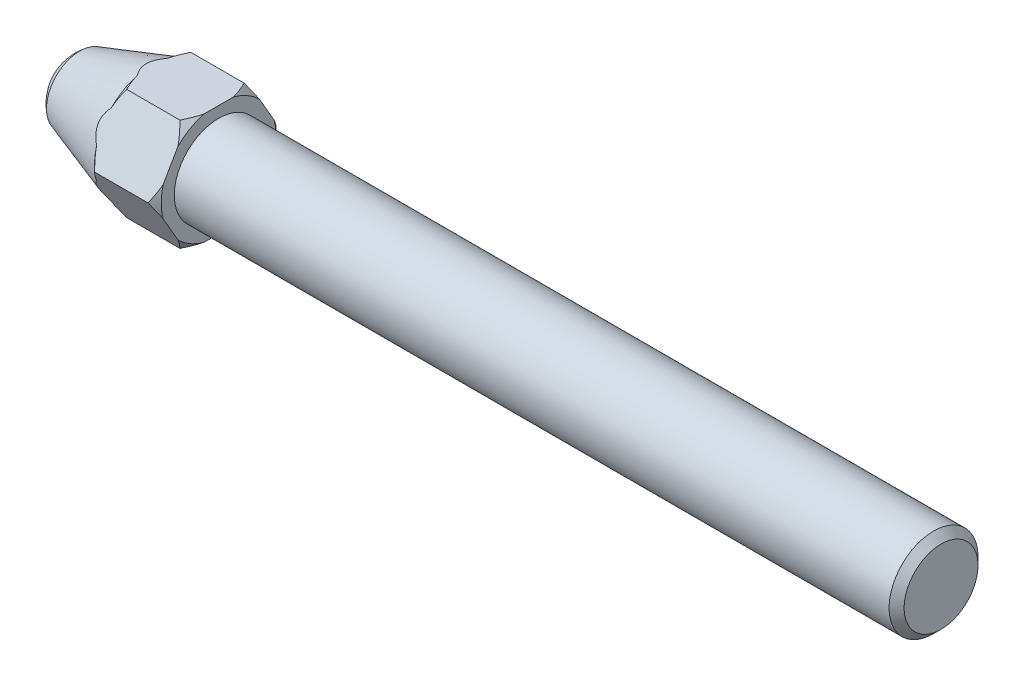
ISO-10303-21;
HEADER;
FILE_DESCRIPTION(('STEP AP214'),'2;1');
FILE_NAME('part.step','',(''),(''),'','','');
FILE_SCHEMA(('AUTOMOTIVE_DESIGN { 1 0 10303 214 1 1 1 1 }'));
ENDSEC;
DATA;
#1=APPLICATION_CONTEXT('core data for automotive mechanical design processes');
#2=APPLICATION_PROTOCOL_DEFINITION('international standard','automotive_design',2000,#1);
#3=PRODUCT_CONTEXT('',#1,'mechanical');
#4=PRODUCT('Part','Part','',(#3));
#5=PRODUCT_RELATED_PRODUCT_CATEGORY('part','',(#4));
#6=PRODUCT_DEFINITION_FORMATION('','',#4);
#7=PRODUCT_DEFINITION_CONTEXT('part definition',#1,'design');
#8=PRODUCT_DEFINITION('design','',#6,#7);
#9=PRODUCT_DEFINITION_SHAPE('','',#8);
#10=(LENGTH_UNIT() NAMED_UNIT(*) SI_UNIT(.MILLI.,.METRE.));
#11=(NAMED_UNIT(*) PLANE_ANGLE_UNIT() SI_UNIT($,.RADIAN.));
#12=(NAMED_UNIT(*) SI_UNIT($,.STERADIAN.) SOLID_ANGLE_UNIT());
#13=UNCERTAINTY_MEASURE_WITH_UNIT(LENGTH_MEASURE(1.E-05),#10,'distance_accuracy_value','');
#14=(GEOMETRIC_REPRESENTATION_CONTEXT(3) GLOBAL_UNCERTAINTY_ASSIGNED_CONTEXT((#13)) GLOBAL_UNIT_ASSIGNED_CONTEXT((#10,
#11,#12)) REPRESENTATION_CONTEXT('',''));
#15=CARTESIAN_POINT('',(0.,0.,0.));
#16=DIRECTION('',(0.,0.,1.));
#17=DIRECTION('',(1.,0.,0.));
#18=AXIS2_PLACEMENT_3D('',#15,#16,#17);
#19=CARTESIAN_POINT('',(-0.6,0.,0.));
#20=DIRECTION('',(-1.,0.,0.));
#21=DIRECTION('',(0.,0.,1.));
#22=AXIS2_PLACEMENT_3D('',#19,#20,#21);
#23=CONICAL_SURFACE('',#22,5.7735,0.785398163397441);
#24=CARTESIAN_POINT('',(1.99999999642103E-06,-1.34942130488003,-4.9944112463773));
#25=CARTESIAN_POINT('',(-0.0347380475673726,-1.23225454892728,-5.0620575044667));
#26=CARTESIAN_POINT('',(-0.07411718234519,-1.11618659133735,-5.12906937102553));
#27=CARTESIAN_POINT('',(-0.160813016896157,-0.886644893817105,-5.26159533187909));
#28=CARTESIAN_POINT('',(-0.208107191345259,-0.773164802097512,-5.32711309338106));
#29=CARTESIAN_POINT('',(-0.309474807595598,-0.548596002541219,-5.45676795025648));
#30=CARTESIAN_POINT('',(-0.363544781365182,-0.437506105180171,-5.52090573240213));
#31=CARTESIAN_POINT('',(-0.47760750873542,-0.217248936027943,-5.64807126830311));
#32=CARTESIAN_POINT('',(-0.537616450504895,-0.108087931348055,-5.71109540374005));
#33=CARTESIAN_POINT('',(-0.600001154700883,2.00000000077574E-06,-5.77350115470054));
#34=B_SPLINE_CURVE_WITH_KNOTS('',3,(#24,#25,#26,#27,#28,#29,#30,#31,#32,#33),.UNSPECIFIED.,.F.,
.F.,(4,2,2,2,4),(0.,0.418854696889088,0.836537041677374,1.25400647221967,1.67264691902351),.UNSPECIFIED.);
#35=CARTESIAN_POINT('',(0.,-1.3494145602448,-4.99441514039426));
#36=VERTEX_POINT('',#35);
#37=CARTESIAN_POINT('',(-0.6,0.,-5.7735));
#38=VERTEX_POINT('',#37);
#39=EDGE_CURVE('E283',#36,#38,#34,.T.);
#40=ORIENTED_EDGE('',*,*,#39,.T.);
#41=CARTESIAN_POINT('',(-0.600001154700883,-2.E-06,-5.77350115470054));
#42=CARTESIAN_POINT('',(-0.537616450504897,0.108087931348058,-5.71109540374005));
#43=CARTESIAN_POINT('',(-0.477607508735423,0.217248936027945,-5.64807126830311));
#44=CARTESIAN_POINT('',(-0.363544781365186,0.437506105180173,-5.52090573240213));
#45=CARTESIAN_POINT('',(-0.309474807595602,0.54859600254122,-5.45676795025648));
#46=CARTESIAN_POINT('',(-0.208107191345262,0.773164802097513,-5.32711309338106));
#47=CARTESIAN_POINT('',(-0.160813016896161,0.886644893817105,-5.26159533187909));
#48=CARTESIAN_POINT('',(-0.0741171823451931,1.11618659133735,-5.12906937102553));
#49=CARTESIAN_POINT('',(-0.0347380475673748,1.23225454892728,-5.0620575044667));
#50=CARTESIAN_POINT('',(1.99999999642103E-06,1.34942130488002,-4.9944112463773));
#51=B_SPLINE_CURVE_WITH_KNOTS('',3,(#41,#42,#43,#44,#45,#46,#47,#48,#49,#50),.UNSPECIFIED.,.F.,
.F.,(4,2,2,2,4),(0.,0.418640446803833,0.836109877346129,1.25379222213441,1.6726469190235),.UNSPECIFIED.);
#52=CARTESIAN_POINT('',(0.,1.3494145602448,-4.99441514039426));
#53=VERTEX_POINT('',#52);
#54=EDGE_CURVE('E161',#38,#53,#51,.T.);
#55=ORIENTED_EDGE('',*,*,#54,.T.);
#56=CARTESIAN_POINT('',(0.,0.,0.));
#57=DIRECTION('',(1.,0.,0.));
#58=DIRECTION('',(0.,0.,-1.));
#59=AXIS2_PLACEMENT_3D('',#56,#57,#58);
#60=CIRCLE('',#59,5.1735);
#61=EDGE_CURVE('E454',#36,#53,#60,.T.);
#62=ORIENTED_EDGE('',*,*,#61,.F.);
#63=EDGE_LOOP('',(#40,#55,#62));
#64=FACE_BOUND('',#63,.T.);
#65=ADVANCED_FACE('F15',(#64),#23,.T.);
#66=CARTESIAN_POINT('',(-2.70971590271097,-4.99999766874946,6.09467934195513));
#67=CARTESIAN_POINT('',(-2.59610972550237,-4.99999766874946,5.94770156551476));
#68=CARTESIAN_POINT('',(-2.48350193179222,-4.99999766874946,5.79993988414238));
#69=CARTESIAN_POINT('',(-2.26074154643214,-4.99999766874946,5.50252546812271));
#70=CARTESIAN_POINT('',(-2.1505895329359,-4.99999766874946,5.35287230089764));
#71=CARTESIAN_POINT('',(-1.93241557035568,-4.99999766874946,5.05025899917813));
#72=CARTESIAN_POINT('',(-1.824416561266,-4.99999766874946,4.89728227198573));
#73=CARTESIAN_POINT('',(-1.6121099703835,-4.99999766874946,4.58879683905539));
#74=CARTESIAN_POINT('',(-1.50780213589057,-4.99999766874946,4.43328830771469));
#75=CARTESIAN_POINT('',(-1.29708360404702,-4.99999766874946,4.10909153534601));
#76=CARTESIAN_POINT('',(-1.19097776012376,-4.99999766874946,3.94020415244));
#77=CARTESIAN_POINT('',(-0.985254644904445,-4.99999766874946,3.59845906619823));
#78=CARTESIAN_POINT('',(-0.885638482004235,-4.99999766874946,3.42560069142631));
#79=CARTESIAN_POINT('',(-0.695008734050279,-4.99999766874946,3.0758500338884));
#80=CARTESIAN_POINT('',(-0.603969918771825,-4.99999766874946,2.89897161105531));
#81=CARTESIAN_POINT('',(-0.432534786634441,-4.99999766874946,2.54017102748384));
#82=CARTESIAN_POINT('',(-0.352133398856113,-4.99999766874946,2.3582513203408));
#83=CARTESIAN_POINT('',(-0.212491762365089,-4.99999766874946,2.00797892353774));
#84=CARTESIAN_POINT('',(-0.151924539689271,-4.99999766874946,1.84016066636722));
#85=CARTESIAN_POINT('',(-0.0442172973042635,-4.99999766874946,1.50018857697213));
#86=CARTESIAN_POINT('',(0.00292188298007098,-4.99999766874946,1.32803447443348));
#87=CARTESIAN_POINT('',(0.0804105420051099,-4.99999766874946,0.983453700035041));
#88=CARTESIAN_POINT('',(0.111069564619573,-4.99999766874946,0.811097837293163));
#89=CARTESIAN_POINT('',(0.154947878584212,-4.99999766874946,0.464167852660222));
#90=CARTESIAN_POINT('',(0.16817096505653,-4.99999766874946,0.289594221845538));
#91=CARTESIAN_POINT('',(0.176013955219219,-4.99999766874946,-0.0519687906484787));
#92=CARTESIAN_POINT('',(0.171458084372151,-4.99999766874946,-0.218939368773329));
#93=CARTESIAN_POINT('',(0.145903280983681,-4.99999766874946,-0.551608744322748));
#94=CARTESIAN_POINT('',(0.124902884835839,-4.99999766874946,-0.717307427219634));
#95=CARTESIAN_POINT('',(0.067300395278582,-4.99999766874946,-1.04904458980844));
#96=CARTESIAN_POINT('',(0.0304202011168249,-4.99999766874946,-1.21503394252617));
#97=CARTESIAN_POINT('',(-0.0568750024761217,-4.99999766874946,-1.54334561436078));
#98=CARTESIAN_POINT('',(-0.107289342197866,-4.99999766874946,-1.70566811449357));
#99=CARTESIAN_POINT('',(-0.222167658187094,-4.99999766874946,-2.03423617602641));
#100=CARTESIAN_POINT('',(-0.287202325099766,-4.99999766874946,-2.20027985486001));
#101=CARTESIAN_POINT('',(-0.427331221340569,-4.99999766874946,-2.5281044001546));
#102=CARTESIAN_POINT('',(-0.5024299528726,-4.99999766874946,-2.68988331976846));
#103=CARTESIAN_POINT('',(-0.660906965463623,-4.99999766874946,-3.00993680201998));
#104=CARTESIAN_POINT('',(-0.744310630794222,-4.99999766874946,-3.16819869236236));
#105=CARTESIAN_POINT('',(-0.917563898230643,-4.99999766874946,-3.4810990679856));
#106=CARTESIAN_POINT('',(-1.00741251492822,-4.99999766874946,-3.63573810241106));
#107=CARTESIAN_POINT('',(-1.18773979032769,-4.99999766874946,-3.93431569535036));
#108=CARTESIAN_POINT('',(-1.27796879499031,-4.99999766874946,-4.07840583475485));
#109=CARTESIAN_POINT('',(-1.46227631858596,-4.99999766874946,-4.36411025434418));
#110=CARTESIAN_POINT('',(-1.55635512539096,-4.99999766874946,-4.50572434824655));
#111=CARTESIAN_POINT('',(-1.74691261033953,-4.99999766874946,-4.78566429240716));
#112=CARTESIAN_POINT('',(-1.84336603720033,-4.99999766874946,-4.92400739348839));
#113=CARTESIAN_POINT('',(-2.03886522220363,-4.99999766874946,-5.19879437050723));
#114=CARTESIAN_POINT('',(-2.13791025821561,-4.99999766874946,-5.33523875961));
#115=CARTESIAN_POINT('',(-2.23801635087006,-4.99999766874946,-5.47088639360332));
#116=B_SPLINE_CURVE_WITH_KNOTS('',3,(#66,#67,#68,#69,#70,#71,#72,#73,#74,#75,#76,#77,#78,#79,
#80,#81,#82,#83,#84,#85,#86,#87,#88,#89,#90,#91,#92,#93,#94,#95,#96,#97,#98,#99,#100,#101,#102,
#103,#104,#105,#106,#107,#108,#109,#110,#111,#112,#113,#114,#115),.UNSPECIFIED.,.F.,.F.,(4,2,2,
2,2,2,2,2,2,2,2,2,2,2,2,2,2,2,2,2,2,2,2,2,4),(0.,0.557306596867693,1.1147430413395,
1.67647285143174,2.23816413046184,2.83640644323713,3.43475066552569,4.03127599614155,
4.62751592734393,5.16229705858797,5.69711161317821,6.22149480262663,6.74576383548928,
7.24602324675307,7.74632718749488,8.25577395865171,8.76519552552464,9.29976385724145,
9.83457213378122,10.3710684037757,10.9074828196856,11.4174397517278,11.9274348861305,
12.4333459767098,12.9391175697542),.UNSPECIFIED.);
#117=CARTESIAN_POINT('',(0.,-4.99999766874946,-1.32858028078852));
#118=VERTEX_POINT('',#117);
#119=CARTESIAN_POINT('',(-0.6,-4.99999766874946,-2.88675));
#120=VERTEX_POINT('',#119);
#121=EDGE_CURVE('E318',#118,#120,#116,.T.);
#122=ORIENTED_EDGE('',*,*,#121,.T.);
#123=CARTESIAN_POINT('',(-0.600001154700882,-4.99999966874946,-2.88674884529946));
#124=CARTESIAN_POINT('',(-0.537616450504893,-4.89190973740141,-2.94915459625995));
#125=CARTESIAN_POINT('',(-0.477607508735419,-4.78274873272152,-3.01217873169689));
#126=CARTESIAN_POINT('',(-0.363544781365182,-4.56249156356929,-3.13934426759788));
#127=CARTESIAN_POINT('',(-0.309474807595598,-4.45140166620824,-3.20348204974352));
#128=CARTESIAN_POINT('',(-0.208107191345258,-4.22683286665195,-3.33313690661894));
#129=CARTESIAN_POINT('',(-0.160813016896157,-4.11335277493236,-3.39865466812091));
#130=CARTESIAN_POINT('',(-0.0741171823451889,-3.88381107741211,-3.53118062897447));
#131=CARTESIAN_POINT('',(-0.0347380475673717,-3.76774311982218,-3.5981924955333));
#132=CARTESIAN_POINT('',(1.99999999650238E-06,-3.65057636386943,-3.66583875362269));
#133=B_SPLINE_CURVE_WITH_KNOTS('',3,(#123,#124,#125,#126,#127,#128,#129,#130,#131,#132),
.UNSPECIFIED.,.F.,.F.,(4,2,2,2,4),(0.,0.418640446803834,0.83610987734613,1.25379222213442,
1.6726469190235),.UNSPECIFIED.);
#134=CARTESIAN_POINT('',(0.,-3.65058310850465,-3.66583485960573));
#135=VERTEX_POINT('',#134);
#136=EDGE_CURVE('E277',#120,#135,#133,.T.);
#137=ORIENTED_EDGE('',*,*,#136,.T.);
#138=EDGE_CURVE('E481',#118,#135,#60,.T.);
#139=ORIENTED_EDGE('',*,*,#138,.F.);
#140=EDGE_LOOP('',(#122,#137,#139));
#141=FACE_BOUND('',#140,.T.);
#142=ADVANCED_FACE('F506',(#141),#23,.T.);
#143=CARTESIAN_POINT('',(1.9999999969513E-06,-3.65057636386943,3.66583875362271));
#144=CARTESIAN_POINT('',(-0.0347380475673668,-3.76774311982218,3.5981924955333));
#145=CARTESIAN_POINT('',(-0.0741171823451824,-3.88381107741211,3.53118062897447));
#146=CARTESIAN_POINT('',(-0.160813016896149,-4.11335277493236,3.39865466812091));
#147=CARTESIAN_POINT('',(-0.208107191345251,-4.22683286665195,3.33313690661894));
#148=CARTESIAN_POINT('',(-0.30947480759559,-4.45140166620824,3.20348204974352));
#149=CARTESIAN_POINT('',(-0.363544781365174,-4.56249156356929,3.13934426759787));
#150=CARTESIAN_POINT('',(-0.477607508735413,-4.78274873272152,3.01217873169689));
#151=CARTESIAN_POINT('',(-0.537616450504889,-4.8919097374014,2.94915459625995));
#152=CARTESIAN_POINT('',(-0.600001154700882,-4.99999966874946,2.88674884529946));
#153=B_SPLINE_CURVE_WITH_KNOTS('',3,(#143,#144,#145,#146,#147,#148,#149,#150,#151,#152),
.UNSPECIFIED.,.F.,.F.,(4,2,2,2,4),(0.,0.418854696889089,0.836537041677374,1.25400647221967,
1.67264691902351),.UNSPECIFIED.);
#154=CARTESIAN_POINT('',(0.,-3.65058310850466,3.66583485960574));
#155=VERTEX_POINT('',#154);
#156=CARTESIAN_POINT('',(-0.6,-4.99999766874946,2.88675));
#157=VERTEX_POINT('',#156);
#158=EDGE_CURVE('E350',#155,#157,#153,.T.);
#159=ORIENTED_EDGE('',*,*,#158,.T.);
#160=CARTESIAN_POINT('',(0.,-4.99999766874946,1.32858028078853));
#161=VERTEX_POINT('',#160);
#162=EDGE_CURVE('E311',#157,#161,#116,.T.);
#163=ORIENTED_EDGE('',*,*,#162,.T.);
#164=EDGE_CURVE('E488',#155,#161,#60,.T.);
#165=ORIENTED_EDGE('',*,*,#164,.F.);
#166=EDGE_LOOP('',(#159,#163,#165));
#167=FACE_BOUND('',#166,.T.);
#168=ADVANCED_FACE('F503',(#167),#23,.T.);
#169=CARTESIAN_POINT('',(1.99999999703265E-06,1.34942130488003,4.9944112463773));
#170=CARTESIAN_POINT('',(-0.0347380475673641,1.23225454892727,5.0620575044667));
#171=CARTESIAN_POINT('',(-0.0741171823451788,1.11618659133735,5.12906937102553));
#172=CARTESIAN_POINT('',(-0.160813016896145,0.886644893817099,5.26159533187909));
#173=CARTESIAN_POINT('',(-0.208107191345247,0.773164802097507,5.32711309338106));
#174=CARTESIAN_POINT('',(-0.309474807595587,0.548596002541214,5.45676795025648));
#175=CARTESIAN_POINT('',(-0.363544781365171,0.437506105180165,5.52090573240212));
#176=CARTESIAN_POINT('',(-0.47760750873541,0.217248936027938,5.64807126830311));
#177=CARTESIAN_POINT('',(-0.537616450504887,0.108087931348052,5.71109540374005));
#178=CARTESIAN_POINT('',(-0.600001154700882,-2.00000000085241E-06,5.77350115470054));
#179=B_SPLINE_CURVE_WITH_KNOTS('',3,(#169,#170,#171,#172,#173,#174,#175,#176,#177,#178),
.UNSPECIFIED.,.F.,.F.,(4,2,2,2,4),(0.,0.418854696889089,0.836537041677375,1.25400647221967,
1.67264691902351),.UNSPECIFIED.);
#180=CARTESIAN_POINT('',(0.,1.3494145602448,4.99441514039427));
#181=VERTEX_POINT('',#180);
#182=CARTESIAN_POINT('',(-0.6,0.,5.7735));
#183=VERTEX_POINT('',#182);
#184=EDGE_CURVE('E410',#181,#183,#179,.T.);
#185=ORIENTED_EDGE('',*,*,#184,.T.);
#186=CARTESIAN_POINT('',(-0.600001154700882,2.00000000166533E-06,5.77350115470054));
#187=CARTESIAN_POINT('',(-0.537616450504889,-0.108087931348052,5.71109540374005));
#188=CARTESIAN_POINT('',(-0.477607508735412,-0.217248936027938,5.64807126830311));
#189=CARTESIAN_POINT('',(-0.363544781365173,-0.437506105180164,5.52090573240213));
#190=CARTESIAN_POINT('',(-0.309474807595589,-0.548596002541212,5.45676795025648));
#191=CARTESIAN_POINT('',(-0.208107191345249,-0.773164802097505,5.32711309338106));
#192=CARTESIAN_POINT('',(-0.160813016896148,-0.886644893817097,5.26159533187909));
#193=CARTESIAN_POINT('',(-0.0741171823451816,-1.11618659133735,5.12906937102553));
#194=CARTESIAN_POINT('',(-0.0347380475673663,-1.23225454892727,5.0620575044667));
#195=CARTESIAN_POINT('',(1.99999999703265E-06,-1.34942130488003,4.99441124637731));
#196=B_SPLINE_CURVE_WITH_KNOTS('',3,(#186,#187,#188,#189,#190,#191,#192,#193,#194,#195),
.UNSPECIFIED.,.F.,.F.,(4,2,2,2,4),(0.,0.418640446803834,0.83610987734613,1.25379222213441,
1.6726469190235),.UNSPECIFIED.);
#197=CARTESIAN_POINT('',(0.,-1.3494145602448,4.99441514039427));
#198=VERTEX_POINT('',#197);
#199=EDGE_CURVE('E357',#183,#198,#196,.T.);
#200=ORIENTED_EDGE('',*,*,#199,.T.);
#201=EDGE_CURVE('E497',#181,#198,#60,.T.);
#202=ORIENTED_EDGE('',*,*,#201,.F.);
#203=EDGE_LOOP('',(#185,#200,#202));
#204=FACE_BOUND('',#203,.T.);
#205=ADVANCED_FACE('F505',(#204),#23,.T.);
#206=CARTESIAN_POINT('',(0.,3.65058310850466,-3.66583485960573));
#207=VERTEX_POINT('',#206);
#208=CARTESIAN_POINT('',(0.,4.99999766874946,-1.32858028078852));
#209=VERTEX_POINT('',#208);
#210=EDGE_CURVE('E159',#207,#209,#60,.T.);
#211=ORIENTED_EDGE('',*,*,#210,.F.);
#212=CARTESIAN_POINT('',(1.99999999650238E-06,3.65057636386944,-3.66583875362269));
#213=CARTESIAN_POINT('',(-0.0347380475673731,3.76774311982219,-3.5981924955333));
#214=CARTESIAN_POINT('',(-0.0741171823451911,3.88381107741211,-3.53118062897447));
#215=CARTESIAN_POINT('',(-0.16081301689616,4.11335277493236,-3.39865466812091));
#216=CARTESIAN_POINT('',(-0.208107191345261,4.22683286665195,-3.33313690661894));
#217=CARTESIAN_POINT('',(-0.309474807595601,4.45140166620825,-3.20348204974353));
#218=CARTESIAN_POINT('',(-0.363544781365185,4.56249156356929,-3.13934426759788));
#219=CARTESIAN_POINT('',(-0.477607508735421,4.78274873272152,-3.01217873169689));
#220=CARTESIAN_POINT('',(-0.537616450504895,4.89190973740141,-2.94915459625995));
#221=CARTESIAN_POINT('',(-0.600001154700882,4.99999966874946,-2.88674884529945));
#222=B_SPLINE_CURVE_WITH_KNOTS('',3,(#212,#213,#214,#215,#216,#217,#218,#219,#220,#221),
.UNSPECIFIED.,.F.,.F.,(4,2,2,2,4),(0.,0.418854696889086,0.836537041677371,1.25400647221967,
1.6726469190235),.UNSPECIFIED.);
#223=CARTESIAN_POINT('',(-0.6,4.99999766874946,-2.88675));
#224=VERTEX_POINT('',#223);
#225=EDGE_CURVE('E151',#207,#224,#222,.T.);
#226=ORIENTED_EDGE('',*,*,#225,.T.);
#227=CARTESIAN_POINT('',(-2.70971590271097,4.99999766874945,6.09467934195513));
#228=CARTESIAN_POINT('',(-2.59610972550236,4.99999766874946,5.94770156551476));
#229=CARTESIAN_POINT('',(-2.48350193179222,4.99999766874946,5.79993988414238));
#230=CARTESIAN_POINT('',(-2.26074154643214,4.99999766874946,5.50252546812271));
#231=CARTESIAN_POINT('',(-2.1505895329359,4.99999766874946,5.35287230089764));
#232=CARTESIAN_POINT('',(-1.93241557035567,4.99999766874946,5.05025899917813));
#233=CARTESIAN_POINT('',(-1.824416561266,4.99999766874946,4.89728227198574));
#234=CARTESIAN_POINT('',(-1.6121099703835,4.99999766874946,4.58879683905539));
#235=CARTESIAN_POINT('',(-1.50780213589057,4.99999766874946,4.43328830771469));
#236=CARTESIAN_POINT('',(-1.29708360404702,4.99999766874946,4.10909153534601));
#237=CARTESIAN_POINT('',(-1.19097776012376,4.99999766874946,3.94020415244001));
#238=CARTESIAN_POINT('',(-0.985254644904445,4.99999766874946,3.59845906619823));
#239=CARTESIAN_POINT('',(-0.885638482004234,4.99999766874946,3.42560069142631));
#240=CARTESIAN_POINT('',(-0.695008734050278,4.99999766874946,3.0758500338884));
#241=CARTESIAN_POINT('',(-0.603969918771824,4.99999766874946,2.89897161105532));
#242=CARTESIAN_POINT('',(-0.432534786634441,4.99999766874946,2.54017102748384));
#243=CARTESIAN_POINT('',(-0.352133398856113,4.99999766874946,2.3582513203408));
#244=CARTESIAN_POINT('',(-0.212491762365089,4.99999766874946,2.00797892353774));
#245=CARTESIAN_POINT('',(-0.151924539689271,4.99999766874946,1.84016066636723));
#246=CARTESIAN_POINT('',(-0.0442172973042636,4.99999766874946,1.50018857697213));
#247=CARTESIAN_POINT('',(0.00292188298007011,4.99999766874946,1.32803447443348));
#248=CARTESIAN_POINT('',(0.0804105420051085,4.99999766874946,0.983453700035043));
#249=CARTESIAN_POINT('',(0.111069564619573,4.99999766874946,0.811097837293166));
#250=CARTESIAN_POINT('',(0.154947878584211,4.99999766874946,0.464167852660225));
#251=CARTESIAN_POINT('',(0.16817096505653,4.99999766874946,0.289594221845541));
#252=CARTESIAN_POINT('',(0.176013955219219,4.99999766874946,-0.0519687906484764));
#253=CARTESIAN_POINT('',(0.17145808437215,4.99999766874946,-0.218939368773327));
#254=CARTESIAN_POINT('',(0.14590328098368,4.99999766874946,-0.551608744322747));
#255=CARTESIAN_POINT('',(0.124902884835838,4.99999766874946,-0.717307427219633));
#256=CARTESIAN_POINT('',(0.0673003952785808,4.99999766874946,-1.04904458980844));
#257=CARTESIAN_POINT('',(0.0304202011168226,4.99999766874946,-1.21503394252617));
#258=CARTESIAN_POINT('',(-0.0568750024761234,4.99999766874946,-1.54334561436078));
#259=CARTESIAN_POINT('',(-0.107289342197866,4.99999766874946,-1.70566811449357));
#260=CARTESIAN_POINT('',(-0.222167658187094,4.99999766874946,-2.03423617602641));
#261=CARTESIAN_POINT('',(-0.287202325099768,4.99999766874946,-2.20027985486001));
#262=CARTESIAN_POINT('',(-0.427331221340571,4.99999766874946,-2.5281044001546));
#263=CARTESIAN_POINT('',(-0.502429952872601,4.99999766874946,-2.68988331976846));
#264=CARTESIAN_POINT('',(-0.660906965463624,4.99999766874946,-3.00993680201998));
#265=CARTESIAN_POINT('',(-0.744310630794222,4.99999766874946,-3.16819869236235));
#266=CARTESIAN_POINT('',(-0.917563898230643,4.99999766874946,-3.48109906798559));
#267=CARTESIAN_POINT('',(-1.00741251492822,4.99999766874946,-3.63573810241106));
#268=CARTESIAN_POINT('',(-1.18773979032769,4.99999766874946,-3.93431569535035));
#269=CARTESIAN_POINT('',(-1.27796879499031,4.99999766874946,-4.07840583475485));
#270=CARTESIAN_POINT('',(-1.46227631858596,4.99999766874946,-4.36411025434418));
#271=CARTESIAN_POINT('',(-1.55635512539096,4.99999766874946,-4.50572434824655));
#272=CARTESIAN_POINT('',(-1.74691261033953,4.99999766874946,-4.78566429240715));
#273=CARTESIAN_POINT('',(-1.84336603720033,4.99999766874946,-4.92400739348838));
#274=CARTESIAN_POINT('',(-2.03886522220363,4.99999766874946,-5.19879437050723));
#275=CARTESIAN_POINT('',(-2.13791025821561,4.99999766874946,-5.33523875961));
#276=CARTESIAN_POINT('',(-2.23801635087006,4.99999766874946,-5.47088639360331));
#277=B_SPLINE_CURVE_WITH_KNOTS('',3,(#227,#228,#229,#230,#231,#232,#233,#234,#235,#236,#237,
#238,#239,#240,#241,#242,#243,#244,#245,#246,#247,#248,#249,#250,#251,#252,#253,#254,#255,#256,
#257,#258,#259,#260,#261,#262,#263,#264,#265,#266,#267,#268,#269,#270,#271,#272,#273,#274,#275,
#276),.UNSPECIFIED.,.F.,.F.,(4,2,2,2,2,2,2,2,2,2,2,2,2,2,2,2,2,2,2,2,2,2,2,2,4),(0.,
0.557306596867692,1.1147430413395,1.67647285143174,2.23816413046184,2.83640644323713,
3.43475066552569,4.03127599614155,4.62751592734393,5.16229705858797,5.69711161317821,
6.22149480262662,6.74576383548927,7.24602324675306,7.74632718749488,8.25577395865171,
8.76519552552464,9.29976385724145,9.83457213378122,10.3710684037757,10.9074828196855,
11.4174397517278,11.9274348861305,12.4333459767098,12.9391175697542),.UNSPECIFIED.);
#278=EDGE_CURVE('E139',#224,#209,#277,.F.);
#279=ORIENTED_EDGE('',*,*,#278,.T.);
#280=EDGE_LOOP('',(#211,#226,#279));
#281=FACE_BOUND('',#280,.T.);
#282=ADVANCED_FACE('F158',(#281),#23,.T.);
#283=CARTESIAN_POINT('',(0.,4.99999766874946,1.32858028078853));
#284=VERTEX_POINT('',#283);
#285=CARTESIAN_POINT('',(-0.6,4.99999766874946,2.88675));
#286=VERTEX_POINT('',#285);
#287=EDGE_CURVE('E38',#284,#286,#277,.F.);
#288=ORIENTED_EDGE('',*,*,#287,.T.);
#289=CARTESIAN_POINT('',(-0.600001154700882,4.99999966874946,2.88674884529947));
#290=CARTESIAN_POINT('',(-0.537616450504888,4.8919097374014,2.94915459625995));
#291=CARTESIAN_POINT('',(-0.477607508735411,4.78274873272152,3.01217873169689));
#292=CARTESIAN_POINT('',(-0.363544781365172,4.56249156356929,3.13934426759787));
#293=CARTESIAN_POINT('',(-0.309474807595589,4.45140166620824,3.20348204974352));
#294=CARTESIAN_POINT('',(-0.208107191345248,4.22683286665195,3.33313690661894));
#295=CARTESIAN_POINT('',(-0.160813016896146,4.11335277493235,3.39865466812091));
#296=CARTESIAN_POINT('',(-0.0741171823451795,3.8838110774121,3.53118062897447));
#297=CARTESIAN_POINT('',(-0.0347380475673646,3.76774311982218,3.5981924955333));
#298=CARTESIAN_POINT('',(1.9999999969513E-06,3.65057636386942,3.66583875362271));
#299=B_SPLINE_CURVE_WITH_KNOTS('',3,(#289,#290,#291,#292,#293,#294,#295,#296,#297,#298),
.UNSPECIFIED.,.F.,.F.,(4,2,2,2,4),(0.,0.418640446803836,0.836109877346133,1.25379222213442,
1.67264691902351),.UNSPECIFIED.);
#300=CARTESIAN_POINT('',(0.,3.65058310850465,3.66583485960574));
#301=VERTEX_POINT('',#300);
#302=EDGE_CURVE('E404',#286,#301,#299,.T.);
#303=ORIENTED_EDGE('',*,*,#302,.T.);
#304=EDGE_CURVE('E492',#284,#301,#60,.T.);
#305=ORIENTED_EDGE('',*,*,#304,.F.);
#306=EDGE_LOOP('',(#288,#303,#305));
#307=FACE_BOUND('',#306,.T.);
#308=ADVANCED_FACE('F514',(#307),#23,.T.);
#309=CARTESIAN_POINT('',(0.,5.1735,0.));
#310=DIRECTION('',(-1.,0.,0.));
#311=DIRECTION('',(0.,0.,1.));
#312=AXIS2_PLACEMENT_3D('',#309,#310,#311);
#313=PLANE('',#312);
#314=CARTESIAN_POINT('',(0.,0.,0.));
#315=DIRECTION('',(1.,0.,0.));
#316=DIRECTION('',(0.,0.,-1.));
#317=AXIS2_PLACEMENT_3D('',#314,#315,#316);
#318=CIRCLE('',#317,4.);
#319=CARTESIAN_POINT('',(0.,0.,-4.));
#320=VERTEX_POINT('',#319);
#321=EDGE_CURVE('E484',#320,#320,#318,.T.);
#322=ORIENTED_EDGE('',*,*,#321,.F.);
#323=EDGE_LOOP('',(#322));
#324=FACE_BOUND('',#323,.T.);
#325=ORIENTED_EDGE('',*,*,#61,.T.);
#326=DIRECTION('',(0.,0.866025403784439,0.5));
#327=VECTOR('',#326,1.);
#328=CARTESIAN_POINT('',(0.,6.38012383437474,-2.08993378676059));
#329=LINE('',#328,#327);
#330=EDGE_CURVE('E10',#53,#207,#329,.T.);
#331=ORIENTED_EDGE('',*,*,#330,.T.);
#332=ORIENTED_EDGE('',*,*,#210,.T.);
#333=DIRECTION('',(0.,0.,1.));
#334=VECTOR('',#333,1.);
#335=CARTESIAN_POINT('',(0.,4.99999766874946,0.));
#336=LINE('',#335,#334);
#337=EDGE_CURVE('E141',#209,#284,#336,.T.);
#338=ORIENTED_EDGE('',*,*,#337,.T.);
#339=ORIENTED_EDGE('',*,*,#304,.T.);
#340=DIRECTION('',(0.,-0.866025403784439,0.5));
#341=VECTOR('',#340,1.);
#342=CARTESIAN_POINT('',(0.,6.38012383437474,2.0899337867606));
#343=LINE('',#342,#341);
#344=EDGE_CURVE('E461',#301,#181,#343,.T.);
#345=ORIENTED_EDGE('',*,*,#344,.T.);
#346=ORIENTED_EDGE('',*,*,#201,.T.);
#347=DIRECTION('',(0.,-0.866025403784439,-0.5));
#348=VECTOR('',#347,1.);
#349=CARTESIAN_POINT('',(0.,1.38012616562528,6.57031621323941));
#350=LINE('',#349,#348);
#351=EDGE_CURVE('E465',#198,#155,#350,.T.);
#352=ORIENTED_EDGE('',*,*,#351,.T.);
#353=ORIENTED_EDGE('',*,*,#164,.T.);
#354=DIRECTION('',(0.,0.,-1.));
#355=VECTOR('',#354,1.);
#356=CARTESIAN_POINT('',(0.,-4.99999766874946,0.));
#357=LINE('',#356,#355);
#358=EDGE_CURVE('E469',#161,#118,#357,.T.);
#359=ORIENTED_EDGE('',*,*,#358,.T.);
#360=ORIENTED_EDGE('',*,*,#138,.T.);
#361=DIRECTION('',(0.,0.866025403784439,-0.5));
#362=VECTOR('',#361,1.);
#363=CARTESIAN_POINT('',(0.,1.38012616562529,-6.5703162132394));
#364=LINE('',#363,#362);
#365=EDGE_CURVE('E24',#135,#36,#364,.T.);
#366=ORIENTED_EDGE('',*,*,#365,.T.);
#367=EDGE_LOOP('',(#325,#331,#332,#338,#339,#345,#346,#352,#353,#359,#360,#366));
#368=FACE_BOUND('',#367,.T.);
#369=ADVANCED_FACE('F479',(#324,#368),#313,.F.);
#370=CARTESIAN_POINT('',(65.,3.32321694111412,0.));
#371=DIRECTION('',(-1.,0.,0.));
#372=DIRECTION('',(0.,0.,1.));
#373=AXIS2_PLACEMENT_3D('',#370,#371,#372);
#374=PLANE('',#373);
#375=CARTESIAN_POINT('',(65.,0.,0.));
#376=DIRECTION('',(1.,0.,0.));
#377=DIRECTION('',(0.,0.,-1.));
#378=AXIS2_PLACEMENT_3D('',#375,#376,#377);
#379=CIRCLE('',#378,3.32321694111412);
#380=CARTESIAN_POINT('',(65.,0.,-3.32321694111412));
#381=VERTEX_POINT('',#380);
#382=EDGE_CURVE('E673',#381,#381,#379,.T.);
#383=ORIENTED_EDGE('',*,*,#382,.T.);
#384=EDGE_LOOP('',(#383));
#385=FACE_BOUND('',#384,.T.);
#386=ADVANCED_FACE('F17',(#385),#374,.F.);
#387=CARTESIAN_POINT('',(65.,0.,0.));
#388=DIRECTION('',(1.,0.,0.));
#389=DIRECTION('',(0.,0.,-1.));
#390=AXIS2_PLACEMENT_3D('',#387,#388,#389);
#391=CYLINDRICAL_SURFACE('',#390,4.);
#392=CARTESIAN_POINT('',(64.3232169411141,0.,0.));
#393=DIRECTION('',(1.,0.,0.));
#394=DIRECTION('',(0.,0.,-1.));
#395=AXIS2_PLACEMENT_3D('',#392,#393,#394);
#396=CIRCLE('',#395,4.);
#397=CARTESIAN_POINT('',(64.3232169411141,0.,-4.));
#398=VERTEX_POINT('',#397);
#399=EDGE_CURVE('E491',#398,#398,#396,.T.);
#400=ORIENTED_EDGE('',*,*,#399,.F.);
#401=EDGE_LOOP('',(#400));
#402=FACE_BOUND('',#401,.T.);
#403=ORIENTED_EDGE('',*,*,#321,.T.);
#404=EDGE_LOOP('',(#403));
#405=FACE_BOUND('',#404,.T.);
#406=ADVANCED_FACE('F681',(#402,#405),#391,.T.);
#407=CARTESIAN_POINT('',(64.3232169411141,0.,0.));
#408=DIRECTION('',(-1.,0.,0.));
#409=DIRECTION('',(0.,0.,1.));
#410=AXIS2_PLACEMENT_3D('',#407,#408,#409);
#411=CONICAL_SURFACE('',#410,4.,0.785398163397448);
#412=ORIENTED_EDGE('',*,*,#382,.F.);
#413=EDGE_LOOP('',(#412));
#414=FACE_BOUND('',#413,.T.);
#415=ORIENTED_EDGE('',*,*,#399,.T.);
#416=EDGE_LOOP('',(#415));
#417=FACE_BOUND('',#416,.T.);
#418=ADVANCED_FACE('F196',(#414,#417),#411,.T.);
#419=CARTESIAN_POINT('',(-14.,4.99999766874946,-2.88675));
#420=DIRECTION('',(0.,-0.5,0.866025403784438));
#421=DIRECTION('',(0.,0.866025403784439,0.5));
#422=AXIS2_PLACEMENT_3D('',#419,#420,#421);
#423=PLANE('',#422);
#424=CARTESIAN_POINT('',(-5.39999884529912,4.99999966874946,-2.88674884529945));
#425=CARTESIAN_POINT('',(-5.4623835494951,4.8919097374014,-2.94915459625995));
#426=CARTESIAN_POINT('',(-5.52239249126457,4.78274873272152,-3.01217873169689));
#427=CARTESIAN_POINT('',(-5.63645521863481,4.56249156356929,-3.13934426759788));
#428=CARTESIAN_POINT('',(-5.6905251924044,4.45140166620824,-3.20348204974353));
#429=CARTESIAN_POINT('',(-5.79189280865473,4.22683286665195,-3.33313690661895));
#430=CARTESIAN_POINT('',(-5.83918698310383,4.11335277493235,-3.39865466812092));
#431=CARTESIAN_POINT('',(-5.9258828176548,3.8838110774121,-3.53118062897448));
#432=CARTESIAN_POINT('',(-5.96526195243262,3.76774311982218,-3.5981924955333));
#433=CARTESIAN_POINT('',(-6.000002,3.65057636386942,-3.66583875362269));
#434=B_SPLINE_CURVE_WITH_KNOTS('',3,(#424,#425,#426,#427,#428,#429,#430,#431,#432,#433),
.UNSPECIFIED.,.F.,.F.,(4,2,2,2,4),(0.,0.418640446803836,0.836109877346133,1.25379222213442,
1.67264691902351),.UNSPECIFIED.);
#435=CARTESIAN_POINT('',(-5.4,4.99999766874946,-2.88675));
#436=VERTEX_POINT('',#435);
#437=CARTESIAN_POINT('',(-6.,3.65058310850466,-3.66583485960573));
#438=VERTEX_POINT('',#437);
#439=EDGE_CURVE('E153',#436,#438,#434,.T.);
#440=ORIENTED_EDGE('',*,*,#439,.F.);
#441=DIRECTION('',(1.,0.,0.));
#442=VECTOR('',#441,1.);
#443=CARTESIAN_POINT('',(-14.,4.99999766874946,-2.88675));
#444=LINE('',#443,#442);
#445=EDGE_CURVE('E31',#436,#224,#444,.T.);
#446=ORIENTED_EDGE('',*,*,#445,.T.);
#447=ORIENTED_EDGE('',*,*,#225,.F.);
#448=ORIENTED_EDGE('',*,*,#330,.F.);
#449=ORIENTED_EDGE('',*,*,#54,.F.);
#450=DIRECTION('',(1.,0.,0.));
#451=VECTOR('',#450,1.);
#452=CARTESIAN_POINT('',(-14.,0.,-5.7735));
#453=LINE('',#452,#451);
#454=CARTESIAN_POINT('',(-5.4,0.,-5.7735));
#455=VERTEX_POINT('',#454);
#456=EDGE_CURVE('E525',#455,#38,#453,.T.);
#457=ORIENTED_EDGE('',*,*,#456,.F.);
#458=CARTESIAN_POINT('',(-6.000002,1.34942130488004,-4.99441124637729));
#459=CARTESIAN_POINT('',(-5.96526195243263,1.23225454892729,-5.06205750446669));
#460=CARTESIAN_POINT('',(-5.92588281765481,1.11618659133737,-5.12906937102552));
#461=CARTESIAN_POINT('',(-5.83918698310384,0.886644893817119,-5.26159533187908));
#462=CARTESIAN_POINT('',(-5.79189280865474,0.773164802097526,-5.32711309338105));
#463=CARTESIAN_POINT('',(-5.6905251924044,0.548596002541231,-5.45676795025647));
#464=CARTESIAN_POINT('',(-5.63645521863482,0.437506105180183,-5.52090573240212));
#465=CARTESIAN_POINT('',(-5.52239249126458,0.217248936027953,-5.64807126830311));
#466=CARTESIAN_POINT('',(-5.46238354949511,0.108087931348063,-5.71109540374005));
#467=CARTESIAN_POINT('',(-5.39999884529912,-1.99999999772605E-06,-5.77350115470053));
#468=B_SPLINE_CURVE_WITH_KNOTS('',3,(#458,#459,#460,#461,#462,#463,#464,#465,#466,#467),
.UNSPECIFIED.,.F.,.F.,(4,2,2,2,4),(0.,0.418854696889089,0.836537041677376,1.25400647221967,
1.67264691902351),.UNSPECIFIED.);
#469=CARTESIAN_POINT('',(-6.,1.34941456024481,-4.99441514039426));
#470=VERTEX_POINT('',#469);
#471=EDGE_CURVE('E169',#470,#455,#468,.T.);
#472=ORIENTED_EDGE('',*,*,#471,.F.);
#473=CARTESIAN_POINT('',(-5.999998,3.65058536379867,-3.66583355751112));
#474=CARTESIAN_POINT('',(-6.07149601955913,3.5698380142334,-3.71245306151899));
#475=CARTESIAN_POINT('',(-6.13900866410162,3.48587808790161,-3.76092734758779));
#476=CARTESIAN_POINT('',(-6.26262712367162,3.30980717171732,-3.86258193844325));
#477=CARTESIAN_POINT('',(-6.31849718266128,3.21757353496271,-3.91583305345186));
#478=CARTESIAN_POINT('',(-6.41284062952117,3.0252918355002,-4.02684694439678));
#479=CARTESIAN_POINT('',(-6.45113886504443,2.925176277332,-4.08464868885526));
#480=CARTESIAN_POINT('',(-6.50343929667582,2.72112506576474,-4.20245771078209));
#481=CARTESIAN_POINT('',(-6.51768166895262,2.61723788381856,-4.26243700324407));
#482=CARTESIAN_POINT('',(-6.51976598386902,2.42352245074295,-4.37427866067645));
#483=CARTESIAN_POINT('',(-6.51094878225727,2.33371243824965,-4.42613049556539));
#484=CARTESIAN_POINT('',(-6.47495712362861,2.15616825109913,-4.52863567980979));
#485=CARTESIAN_POINT('',(-6.44762292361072,2.06845907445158,-4.57927459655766));
#486=CARTESIAN_POINT('',(-6.36539868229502,1.8674301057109,-4.695338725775));
#487=CARTESIAN_POINT('',(-6.30415637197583,1.7561391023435,-4.75959261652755));
#488=CARTESIAN_POINT('',(-6.16350658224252,1.54484780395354,-4.88158170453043));
#489=CARTESIAN_POINT('',(-6.08442224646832,1.44468898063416,-4.93940842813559));
#490=CARTESIAN_POINT('',(-5.999998,1.34941230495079,-4.99441644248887));
#491=B_SPLINE_CURVE_WITH_KNOTS('',3,(#473,#474,#475,#476,#477,#478,#479,#480,#481,#482,#483,
#484,#485,#486,#487,#488,#489,#490),.UNSPECIFIED.,.F.,.F.,(4,2,2,2,2,2,2,2,4),(0.,
0.353165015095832,0.712904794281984,1.07615638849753,1.4357593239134,1.74623549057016,
2.05942477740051,2.48436619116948,2.90215422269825),.UNSPECIFIED.);
#492=EDGE_CURVE('E209',#438,#470,#491,.T.);
#493=ORIENTED_EDGE('',*,*,#492,.F.);
#494=EDGE_LOOP('',(#440,#446,#447,#448,#449,#457,#472,#493));
#495=FACE_BOUND('',#494,.T.);
#496=ADVANCED_FACE('F150',(#495),#423,.F.);
#497=CARTESIAN_POINT('',(-14.,0.,-5.7735));
#498=DIRECTION('',(0.,0.5,0.866025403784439));
#499=DIRECTION('',(0.,0.866025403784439,-0.5));
#500=AXIS2_PLACEMENT_3D('',#497,#498,#499);
#501=PLANE('',#500);
#502=CARTESIAN_POINT('',(-5.39999884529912,2.E-06,-5.77350115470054));
#503=CARTESIAN_POINT('',(-5.46238354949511,-0.108087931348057,-5.71109540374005));
#504=CARTESIAN_POINT('',(-5.52239249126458,-0.217248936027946,-5.64807126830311));
#505=CARTESIAN_POINT('',(-5.63645521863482,-0.437506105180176,-5.52090573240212));
#506=CARTESIAN_POINT('',(-5.6905251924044,-0.548596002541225,-5.45676795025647));
#507=CARTESIAN_POINT('',(-5.79189280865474,-0.77316480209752,-5.32711309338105));
#508=CARTESIAN_POINT('',(-5.83918698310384,-0.886644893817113,-5.26159533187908));
#509=CARTESIAN_POINT('',(-5.92588281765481,-1.11618659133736,-5.12906937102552));
#510=CARTESIAN_POINT('',(-5.96526195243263,-1.23225454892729,-5.06205750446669));
#511=CARTESIAN_POINT('',(-6.000002,-1.34942130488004,-4.99441124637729));
#512=B_SPLINE_CURVE_WITH_KNOTS('',3,(#502,#503,#504,#505,#506,#507,#508,#509,#510,#511),
.UNSPECIFIED.,.F.,.F.,(4,2,2,2,4),(0.,0.418640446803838,0.836109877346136,1.25379222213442,
1.67264691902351),.UNSPECIFIED.);
#513=CARTESIAN_POINT('',(-6.,-1.3494145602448,-4.99441514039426));
#514=VERTEX_POINT('',#513);
#515=EDGE_CURVE('E162',#455,#514,#512,.T.);
#516=ORIENTED_EDGE('',*,*,#515,.F.);
#517=ORIENTED_EDGE('',*,*,#456,.T.);
#518=ORIENTED_EDGE('',*,*,#39,.F.);
#519=ORIENTED_EDGE('',*,*,#365,.F.);
#520=ORIENTED_EDGE('',*,*,#136,.F.);
#521=DIRECTION('',(1.,0.,0.));
#522=VECTOR('',#521,1.);
#523=CARTESIAN_POINT('',(-14.,-4.99999766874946,-2.88675));
#524=LINE('',#523,#522);
#525=CARTESIAN_POINT('',(-5.4,-4.99999766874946,-2.88675));
#526=VERTEX_POINT('',#525);
#527=EDGE_CURVE('E530',#526,#120,#524,.T.);
#528=ORIENTED_EDGE('',*,*,#527,.F.);
#529=CARTESIAN_POINT('',(-6.000002,-3.65057636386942,-3.66583875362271));
#530=CARTESIAN_POINT('',(-5.96526195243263,-3.76774311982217,-3.59819249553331));
#531=CARTESIAN_POINT('',(-5.92588281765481,-3.88381107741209,-3.53118062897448));
#532=CARTESIAN_POINT('',(-5.83918698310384,-4.11335277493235,-3.39865466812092));
#533=CARTESIAN_POINT('',(-5.79189280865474,-4.22683286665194,-3.33313690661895));
#534=CARTESIAN_POINT('',(-5.6905251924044,-4.45140166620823,-3.20348204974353));
#535=CARTESIAN_POINT('',(-5.63645521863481,-4.56249156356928,-3.13934426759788));
#536=CARTESIAN_POINT('',(-5.52239249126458,-4.78274873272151,-3.01217873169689));
#537=CARTESIAN_POINT('',(-5.4623835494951,-4.8919097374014,-2.94915459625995));
#538=CARTESIAN_POINT('',(-5.39999884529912,-4.99999966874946,-2.88674884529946));
#539=B_SPLINE_CURVE_WITH_KNOTS('',3,(#529,#530,#531,#532,#533,#534,#535,#536,#537,#538),
.UNSPECIFIED.,.F.,.F.,(4,2,2,2,4),(0.,0.418854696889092,0.83653704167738,1.25400647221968,
1.67264691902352),.UNSPECIFIED.);
#540=CARTESIAN_POINT('',(-6.,-3.65058310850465,-3.66583485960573));
#541=VERTEX_POINT('',#540);
#542=EDGE_CURVE('E270',#541,#526,#539,.T.);
#543=ORIENTED_EDGE('',*,*,#542,.F.);
#544=CARTESIAN_POINT('',(-5.999998,-1.34941230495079,-4.99441644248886));
#545=CARTESIAN_POINT('',(-6.07149601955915,-1.43015965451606,-4.94779693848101));
#546=CARTESIAN_POINT('',(-6.13900866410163,-1.51411958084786,-4.89932265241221));
#547=CARTESIAN_POINT('',(-6.26262712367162,-1.69019049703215,-4.79766806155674));
#548=CARTESIAN_POINT('',(-6.31849718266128,-1.78242413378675,-4.74441694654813));
#549=CARTESIAN_POINT('',(-6.41284062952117,-1.97470583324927,-4.63340305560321));
#550=CARTESIAN_POINT('',(-6.45113886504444,-2.07482139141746,-4.57560131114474));
#551=CARTESIAN_POINT('',(-6.50343929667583,-2.27887260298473,-4.45779228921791));
#552=CARTESIAN_POINT('',(-6.51768166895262,-2.3827597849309,-4.39781299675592));
#553=CARTESIAN_POINT('',(-6.51976598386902,-2.57647521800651,-4.28597133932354));
#554=CARTESIAN_POINT('',(-6.51094878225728,-2.66628523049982,-4.23411950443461));
#555=CARTESIAN_POINT('',(-6.47495712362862,-2.84382941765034,-4.1316143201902));
#556=CARTESIAN_POINT('',(-6.44762292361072,-2.93153859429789,-4.08097540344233));
#557=CARTESIAN_POINT('',(-6.36539868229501,-3.13256756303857,-3.96491127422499));
#558=CARTESIAN_POINT('',(-6.30415637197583,-3.24385856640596,-3.90065738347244));
#559=CARTESIAN_POINT('',(-6.16350658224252,-3.45514986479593,-3.77866829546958));
#560=CARTESIAN_POINT('',(-6.08442224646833,-3.55530868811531,-3.72084157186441));
#561=CARTESIAN_POINT('',(-5.999998,-3.65058536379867,-3.66583355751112));
#562=B_SPLINE_CURVE_WITH_KNOTS('',3,(#544,#545,#546,#547,#548,#549,#550,#551,#552,#553,#554,
#555,#556,#557,#558,#559,#560,#561),.UNSPECIFIED.,.F.,.F.,(4,2,2,2,2,2,2,2,4),(0.,
0.353165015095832,0.712904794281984,1.07615638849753,1.4357593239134,1.74623549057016,
2.05942477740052,2.48436619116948,2.90215422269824),.UNSPECIFIED.);
#563=EDGE_CURVE('E173',#514,#541,#562,.T.);
#564=ORIENTED_EDGE('',*,*,#563,.F.);
#565=EDGE_LOOP('',(#516,#517,#518,#519,#520,#528,#543,#564));
#566=FACE_BOUND('',#565,.T.);
#567=ADVANCED_FACE('F195',(#566),#501,.F.);
#568=CARTESIAN_POINT('',(-14.,-4.99999766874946,-2.88675));
#569=DIRECTION('',(0.,1.,0.));
#570=DIRECTION('',(0.,0.,-1.));
#571=AXIS2_PLACEMENT_3D('',#568,#569,#570);
#572=PLANE('',#571);
#573=CARTESIAN_POINT('',(-3.29028409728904,-4.99999766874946,6.09467934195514));
#574=CARTESIAN_POINT('',(-3.40389027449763,-4.99999766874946,5.94770156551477));
#575=CARTESIAN_POINT('',(-3.51649806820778,-4.99999766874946,5.79993988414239));
#576=CARTESIAN_POINT('',(-3.73925845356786,-4.99999766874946,5.50252546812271));
#577=CARTESIAN_POINT('',(-3.8494104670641,-4.99999766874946,5.35287230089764));
#578=CARTESIAN_POINT('',(-4.06758442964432,-4.99999766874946,5.05025899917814));
#579=CARTESIAN_POINT('',(-4.175583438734,-4.99999766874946,4.89728227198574));
#580=CARTESIAN_POINT('',(-4.3878900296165,-4.99999766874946,4.58879683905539));
#581=CARTESIAN_POINT('',(-4.49219786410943,-4.99999766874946,4.43328830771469));
#582=CARTESIAN_POINT('',(-4.70291639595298,-4.99999766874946,4.10909153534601));
#583=CARTESIAN_POINT('',(-4.80902223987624,-4.99999766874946,3.94020415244));
#584=CARTESIAN_POINT('',(-5.01474535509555,-4.99999766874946,3.59845906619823));
#585=CARTESIAN_POINT('',(-5.11436151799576,-4.99999766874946,3.4256006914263));
#586=CARTESIAN_POINT('',(-5.30499126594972,-4.99999766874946,3.07585003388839));
#587=CARTESIAN_POINT('',(-5.39603008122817,-4.99999766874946,2.89897161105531));
#588=CARTESIAN_POINT('',(-5.56746521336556,-4.99999766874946,2.54017102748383));
#589=CARTESIAN_POINT('',(-5.64786660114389,-4.99999766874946,2.3582513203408));
#590=CARTESIAN_POINT('',(-5.78750823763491,-4.99999766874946,2.00797892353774));
#591=CARTESIAN_POINT('',(-5.84807546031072,-4.99999766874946,1.84016066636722));
#592=CARTESIAN_POINT('',(-5.95578270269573,-4.99999766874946,1.50018857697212));
#593=CARTESIAN_POINT('',(-6.00292188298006,-4.99999766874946,1.32803447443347));
#594=CARTESIAN_POINT('',(-6.0804105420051,-4.99999766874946,0.98345370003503));
#595=CARTESIAN_POINT('',(-6.11106956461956,-4.99999766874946,0.811097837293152));
#596=CARTESIAN_POINT('',(-6.15494787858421,-4.99999766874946,0.46416785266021));
#597=CARTESIAN_POINT('',(-6.16817096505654,-4.99999766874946,0.289594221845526));
#598=CARTESIAN_POINT('',(-6.17601395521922,-4.99999766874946,-0.0519687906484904));
#599=CARTESIAN_POINT('',(-6.17145808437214,-4.99999766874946,-0.218939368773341));
#600=CARTESIAN_POINT('',(-6.14590328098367,-4.99999766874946,-0.551608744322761));
#601=CARTESIAN_POINT('',(-6.12490288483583,-4.99999766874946,-0.717307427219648));
#602=CARTESIAN_POINT('',(-6.06730039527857,-4.99999766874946,-1.04904458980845));
#603=CARTESIAN_POINT('',(-6.03042020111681,-4.99999766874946,-1.21503394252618));
#604=CARTESIAN_POINT('',(-5.94312499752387,-4.99999766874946,-1.54334561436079));
#605=CARTESIAN_POINT('',(-5.89271065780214,-4.99999766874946,-1.70566811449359));
#606=CARTESIAN_POINT('',(-5.77783234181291,-4.99999766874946,-2.03423617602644));
#607=CARTESIAN_POINT('',(-5.71279767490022,-4.99999766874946,-2.20027985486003));
#608=CARTESIAN_POINT('',(-5.57266877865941,-4.99999766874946,-2.52810440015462));
#609=CARTESIAN_POINT('',(-5.49757004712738,-4.99999766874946,-2.68988331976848));
#610=CARTESIAN_POINT('',(-5.33909303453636,-4.99999766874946,-3.00993680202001));
#611=CARTESIAN_POINT('',(-5.25568936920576,-4.99999766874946,-3.16819869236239));
#612=CARTESIAN_POINT('',(-5.08243610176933,-4.99999766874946,-3.48109906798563));
#613=CARTESIAN_POINT('',(-4.99258748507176,-4.99999766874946,-3.6357381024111));
#614=CARTESIAN_POINT('',(-4.81226020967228,-4.99999766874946,-3.9343156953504));
#615=CARTESIAN_POINT('',(-4.72203120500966,-4.99999766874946,-4.0784058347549));
#616=CARTESIAN_POINT('',(-4.53772368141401,-4.99999766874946,-4.36411025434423));
#617=CARTESIAN_POINT('',(-4.443644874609,-4.99999766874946,-4.50572434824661));
#618=CARTESIAN_POINT('',(-4.25308738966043,-4.99999766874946,-4.78566429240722));
#619=CARTESIAN_POINT('',(-4.15663396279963,-4.99999766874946,-4.92400739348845));
#620=CARTESIAN_POINT('',(-3.96113477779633,-4.99999766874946,-5.1987943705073));
#621=CARTESIAN_POINT('',(-3.86208974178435,-4.99999766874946,-5.33523875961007));
#622=CARTESIAN_POINT('',(-3.7619836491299,-4.99999766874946,-5.47088639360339));
#623=B_SPLINE_CURVE_WITH_KNOTS('',3,(#573,#574,#575,#576,#577,#578,#579,#580,#581,#582,#583,
#584,#585,#586,#587,#588,#589,#590,#591,#592,#593,#594,#595,#596,#597,#598,#599,#600,#601,#602,
#603,#604,#605,#606,#607,#608,#609,#610,#611,#612,#613,#614,#615,#616,#617,#618,#619,#620,#621,
#622),.UNSPECIFIED.,.F.,.F.,(4,2,2,2,2,2,2,2,2,2,2,2,2,2,2,2,2,2,2,2,2,2,2,2,4),(0.,
0.557306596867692,1.1147430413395,1.67647285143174,2.23816413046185,2.83640644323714,
3.4347506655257,4.03127599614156,4.62751592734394,5.16229705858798,5.69711161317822,
6.22149480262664,6.74576383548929,7.24602324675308,7.7463271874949,8.25577395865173,
8.76519552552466,9.29976385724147,9.83457213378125,10.3710684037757,10.9074828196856,
11.4174397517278,11.9274348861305,12.4333459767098,12.9391175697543),.UNSPECIFIED.);
#624=CARTESIAN_POINT('',(-6.,-4.99999766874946,-1.32858028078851));
#625=VERTEX_POINT('',#624);
#626=EDGE_CURVE('E289',#526,#625,#623,.F.);
#627=ORIENTED_EDGE('',*,*,#626,.F.);
#628=ORIENTED_EDGE('',*,*,#527,.T.);
#629=ORIENTED_EDGE('',*,*,#121,.F.);
#630=ORIENTED_EDGE('',*,*,#358,.F.);
#631=ORIENTED_EDGE('',*,*,#162,.F.);
#632=DIRECTION('',(1.,0.,0.));
#633=VECTOR('',#632,1.);
#634=CARTESIAN_POINT('',(-14.,-4.99999766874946,2.88675));
#635=LINE('',#634,#633);
#636=CARTESIAN_POINT('',(-5.4,-4.99999766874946,2.88675));
#637=VERTEX_POINT('',#636);
#638=EDGE_CURVE('E552',#637,#157,#635,.T.);
#639=ORIENTED_EDGE('',*,*,#638,.F.);
#640=CARTESIAN_POINT('',(-6.,-4.99999766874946,1.32858028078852));
#641=VERTEX_POINT('',#640);
#642=EDGE_CURVE('E296',#641,#637,#623,.F.);
#643=ORIENTED_EDGE('',*,*,#642,.F.);
#644=CARTESIAN_POINT('',(5.23117564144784,-4.99999766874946,7.39781332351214));
#645=CARTESIAN_POINT('',(5.00542206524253,-4.99999766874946,7.30669782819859));
#646=CARTESIAN_POINT('',(4.77985015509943,-4.99999766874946,7.21513264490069));
#647=CARTESIAN_POINT('',(4.32911750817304,-4.99999766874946,7.03099005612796));
#648=CARTESIAN_POINT('',(4.10395677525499,-4.99999766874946,6.9384126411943));
#649=CARTESIAN_POINT('',(3.42905768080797,-4.99999766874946,6.6589490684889));
#650=CARTESIAN_POINT('',(2.98001463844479,-4.99999766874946,6.47037674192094));
#651=CARTESIAN_POINT('',(2.09039484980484,-4.99999766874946,6.09010747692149));
#652=CARTESIAN_POINT('',(1.64978554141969,-4.99999766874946,5.89848685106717));
#653=CARTESIAN_POINT('',(0.771811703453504,-4.99999766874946,5.50807194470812));
#654=CARTESIAN_POINT('',(0.334446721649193,-4.99999766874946,5.30927868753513));
#655=CARTESIAN_POINT('',(-0.362810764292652,-4.99999766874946,4.98293286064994));
#656=CARTESIAN_POINT('',(-0.624147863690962,-4.99999766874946,4.85846979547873));
#657=CARTESIAN_POINT('',(-1.14477893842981,-4.99999766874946,4.60519978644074));
#658=CARTESIAN_POINT('',(-1.40407249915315,-4.99999766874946,4.47639198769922));
#659=CARTESIAN_POINT('',(-1.92264645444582,-4.99999766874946,4.21203213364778));
#660=CARTESIAN_POINT('',(-2.18189813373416,-4.99999766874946,4.07642347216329));
#661=CARTESIAN_POINT('',(-2.69647667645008,-4.99999766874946,3.79830127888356));
#662=CARTESIAN_POINT('',(-2.95180587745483,-4.99999766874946,3.65579208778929));
#663=CARTESIAN_POINT('',(-3.46072817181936,-4.99999766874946,3.35956131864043));
#664=CARTESIAN_POINT('',(-3.71424747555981,-4.99999766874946,3.20571115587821));
#665=CARTESIAN_POINT('',(-4.08864326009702,-4.99999766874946,2.96501823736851));
#666=CARTESIAN_POINT('',(-4.21262839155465,-4.99999766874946,2.88301423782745));
#667=CARTESIAN_POINT('',(-4.457921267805,-4.99999766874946,2.71510672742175));
#668=CARTESIAN_POINT('',(-4.57922934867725,-4.99999766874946,2.62920371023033));
#669=CARTESIAN_POINT('',(-4.81690914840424,-4.99999766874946,2.45377677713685));
#670=CARTESIAN_POINT('',(-4.93332334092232,-4.99999766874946,2.36431071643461));
#671=CARTESIAN_POINT('',(-5.16171282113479,-4.99999766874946,2.17971203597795));
#672=CARTESIAN_POINT('',(-5.27368573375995,-4.99999766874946,2.0845764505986));
#673=CARTESIAN_POINT('',(-5.49087300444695,-4.99999766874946,1.88784289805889));
#674=CARTESIAN_POINT('',(-5.59611743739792,-4.99999766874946,1.78627841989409));
#675=CARTESIAN_POINT('',(-5.79768142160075,-4.99999766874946,1.57472660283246));
#676=CARTESIAN_POINT('',(-5.89401330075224,-4.99999766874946,1.46475129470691));
#677=CARTESIAN_POINT('',(-6.03057784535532,-4.99999766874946,1.28948618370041));
#678=CARTESIAN_POINT('',(-6.07561771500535,-4.99999766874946,1.22796082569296));
#679=CARTESIAN_POINT('',(-6.1612029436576,-4.99999766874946,1.10185294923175));
#680=CARTESIAN_POINT('',(-6.20174643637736,-4.99999766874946,1.03726917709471));
#681=CARTESIAN_POINT('',(-6.31462519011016,-4.99999766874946,0.839220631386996));
#682=CARTESIAN_POINT('',(-6.37881374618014,-4.99999766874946,0.700721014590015));
#683=CARTESIAN_POINT('',(-6.45740668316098,-4.99999766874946,0.463225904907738));
#684=CARTESIAN_POINT('',(-6.481375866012,-4.99999766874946,0.367411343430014));
#685=CARTESIAN_POINT('',(-6.51272788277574,-4.99999766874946,0.17300151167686));
#686=CARTESIAN_POINT('',(-6.52011282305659,-4.99999766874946,0.0744065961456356));
#687=CARTESIAN_POINT('',(-6.5172805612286,-4.99999766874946,-0.12263033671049));
#688=CARTESIAN_POINT('',(-6.50704329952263,-4.99999766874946,-0.221072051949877));
#689=CARTESIAN_POINT('',(-6.47030071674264,-4.99999766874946,-0.41479342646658));
#690=CARTESIAN_POINT('',(-6.44378886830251,-4.99999766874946,-0.510071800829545));
#691=CARTESIAN_POINT('',(-6.36357059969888,-4.99999766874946,-0.734163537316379));
#692=CARTESIAN_POINT('',(-6.303150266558,-4.99999766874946,-0.860535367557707));
#693=CARTESIAN_POINT('',(-6.16375133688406,-4.99999766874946,-1.10263377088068));
#694=CARTESIAN_POINT('',(-6.08471009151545,-4.99999766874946,-1.21832253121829));
#695=CARTESIAN_POINT('',(-5.89397104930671,-4.99999766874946,-1.46658666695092));
#696=CARTESIAN_POINT('',(-5.77898348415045,-4.99999766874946,-1.5965879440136));
#697=CARTESIAN_POINT('',(-5.53708994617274,-4.99999766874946,-1.84512787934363));
#698=CARTESIAN_POINT('',(-5.41016117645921,-4.99999766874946,-1.96364369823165));
#699=CARTESIAN_POINT('',(-5.146835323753,-4.99999766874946,-2.1931048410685));
#700=CARTESIAN_POINT('',(-5.01033768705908,-4.99999766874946,-2.30393358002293));
#701=CARTESIAN_POINT('',(-4.80152780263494,-4.99999766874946,-2.46467046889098));
#702=CARTESIAN_POINT('',(-4.73128099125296,-4.99999766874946,-2.51730845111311));
#703=CARTESIAN_POINT('',(-4.58960529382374,-4.99999766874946,-2.62096640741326));
#704=CARTESIAN_POINT('',(-4.51817644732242,-4.99999766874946,-2.67198643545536));
#705=CARTESIAN_POINT('',(-4.28044418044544,-4.99999766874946,-2.83823823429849));
#706=CARTESIAN_POINT('',(-4.11197567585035,-4.99999766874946,-2.95037710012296));
#707=CARTESIAN_POINT('',(-3.77120033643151,-4.99999766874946,-3.16868747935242));
#708=CARTESIAN_POINT('',(-3.59889263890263,-4.99999766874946,-3.27485763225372));
#709=CARTESIAN_POINT('',(-3.25128835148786,-4.99999766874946,-3.4824601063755));
#710=CARTESIAN_POINT('',(-3.07598971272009,-4.99999766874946,-3.58388898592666));
#711=CARTESIAN_POINT('',(-2.72316270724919,-4.99999766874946,-3.78280086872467));
#712=CARTESIAN_POINT('',(-2.54563419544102,-4.99999766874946,-3.88028361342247));
#713=CARTESIAN_POINT('',(-2.0090489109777,-4.99999766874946,-4.16858085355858));
#714=CARTESIAN_POINT('',(-1.64733950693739,-4.99999766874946,-4.35445574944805));
#715=CARTESIAN_POINT('',(-0.919431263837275,-4.99999766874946,-4.71670276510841));
#716=CARTESIAN_POINT('',(-0.553234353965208,-4.99999766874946,-4.89307880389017));
#717=CARTESIAN_POINT('',(0.138653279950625,-4.99999766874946,-5.21814008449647));
#718=CARTESIAN_POINT('',(0.463971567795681,-4.99999766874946,-5.36762073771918));
#719=CARTESIAN_POINT('',(1.11662975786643,-4.99999766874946,-5.6621992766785));
#720=CARTESIAN_POINT('',(1.44396990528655,-4.99999766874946,-5.80729661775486));
#721=CARTESIAN_POINT('',(2.09761873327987,-4.99999766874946,-6.09278448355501));
#722=CARTESIAN_POINT('',(2.42391516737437,-4.99999766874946,-6.2332031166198));
#723=CARTESIAN_POINT('',(3.07770066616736,-4.99999766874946,-6.51106919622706));
#724=CARTESIAN_POINT('',(3.40518949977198,-4.99999766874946,-6.64851718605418));
#725=CARTESIAN_POINT('',(3.73316438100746,-4.99999766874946,-6.78477982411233));
#726=B_SPLINE_CURVE_WITH_KNOTS('',3,(#644,#645,#646,#647,#648,#649,#650,#651,#652,#653,#654,
#655,#656,#657,#658,#659,#660,#661,#662,#663,#664,#665,#666,#667,#668,#669,#670,#671,#672,#673,
#674,#675,#676,#677,#678,#679,#680,#681,#682,#683,#684,#685,#686,#687,#688,#689,#690,#691,#692,
#693,#694,#695,#696,#697,#698,#699,#700,#701,#702,#703,#704,#705,#706,#707,#708,#709,#710,#711,
#712,#713,#714,#715,#716,#717,#718,#719,#720,#721,#722,#723,#724,#725),.UNSPECIFIED.,.F.,.F.,(4,
2,2,2,2,2,2,2,2,2,2,2,2,2,2,2,2,2,2,2,2,2,2,2,2,2,2,2,2,2,2,2,2,2,2,2,2,2,2,2,4),(0.,
0.730341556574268,1.46068994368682,2.92174958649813,4.36312709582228,5.80429976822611,
6.67265444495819,7.54118098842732,8.41882545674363,9.2959248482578,10.1852482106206,
10.6311426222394,11.0769807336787,11.517310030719,11.9578717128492,12.3963021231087,
12.8341167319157,13.0626811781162,13.2913401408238,13.7458227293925,14.0409112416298,
14.3359622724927,14.6313493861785,14.9268550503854,15.3446654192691,15.7639020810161,
16.2833553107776,16.8038211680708,17.3309619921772,17.5942867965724,17.8576028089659,
18.4645494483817,19.0716338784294,19.6791523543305,20.2867105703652,21.5065066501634,
22.7257955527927,23.7998074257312,24.8739522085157,25.9396201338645,27.005091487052),.UNSPECIFIED.);
#727=EDGE_CURVE('E258',#625,#641,#726,.F.);
#728=ORIENTED_EDGE('',*,*,#727,.F.);
#729=EDGE_LOOP('',(#627,#628,#629,#630,#631,#639,#643,#728));
#730=FACE_BOUND('',#729,.T.);
#731=ADVANCED_FACE('F335',(#730),#572,.F.);
#732=CARTESIAN_POINT('',(-14.,-4.99999766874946,2.88675));
#733=DIRECTION('',(0.,0.5,-0.866025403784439));
#734=DIRECTION('',(0.,-0.866025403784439,-0.5));
#735=AXIS2_PLACEMENT_3D('',#732,#733,#734);
#736=PLANE('',#735);
#737=CARTESIAN_POINT('',(-5.39999884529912,-4.99999966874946,2.88674884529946));
#738=CARTESIAN_POINT('',(-5.46238354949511,-4.8919097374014,2.94915459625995));
#739=CARTESIAN_POINT('',(-5.52239249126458,-4.78274873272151,3.01217873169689));
#740=CARTESIAN_POINT('',(-5.63645521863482,-4.56249156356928,3.13934426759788));
#741=CARTESIAN_POINT('',(-5.6905251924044,-4.45140166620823,3.20348204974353));
#742=CARTESIAN_POINT('',(-5.79189280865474,-4.22683286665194,3.33313690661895));
#743=CARTESIAN_POINT('',(-5.83918698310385,-4.11335277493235,3.39865466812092));
#744=CARTESIAN_POINT('',(-5.92588281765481,-3.8838110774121,3.53118062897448));
#745=CARTESIAN_POINT('',(-5.96526195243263,-3.76774311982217,3.59819249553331));
#746=CARTESIAN_POINT('',(-6.000002,-3.65057636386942,3.66583875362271));
#747=B_SPLINE_CURVE_WITH_KNOTS('',3,(#737,#738,#739,#740,#741,#742,#743,#744,#745,#746),
.UNSPECIFIED.,.F.,.F.,(4,2,2,2,4),(0.,0.418640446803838,0.836109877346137,1.25379222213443,
1.67264691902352),.UNSPECIFIED.);
#748=CARTESIAN_POINT('',(-6.,-3.65058310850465,3.66583485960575));
#749=VERTEX_POINT('',#748);
#750=EDGE_CURVE('E328',#637,#749,#747,.T.);
#751=ORIENTED_EDGE('',*,*,#750,.F.);
#752=ORIENTED_EDGE('',*,*,#638,.T.);
#753=ORIENTED_EDGE('',*,*,#158,.F.);
#754=ORIENTED_EDGE('',*,*,#351,.F.);
#755=ORIENTED_EDGE('',*,*,#199,.F.);
#756=DIRECTION('',(1.,0.,0.));
#757=VECTOR('',#756,1.);
#758=CARTESIAN_POINT('',(-14.,0.,5.7735));
#759=LINE('',#758,#757);
#760=CARTESIAN_POINT('',(-5.4,0.,5.7735));
#761=VERTEX_POINT('',#760);
#762=EDGE_CURVE('E551',#761,#183,#759,.T.);
#763=ORIENTED_EDGE('',*,*,#762,.F.);
#764=CARTESIAN_POINT('',(-6.000002,-1.34942130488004,4.9944112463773));
#765=CARTESIAN_POINT('',(-5.96526195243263,-1.23225454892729,5.06205750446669));
#766=CARTESIAN_POINT('',(-5.92588281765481,-1.11618659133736,5.12906937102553));
#767=CARTESIAN_POINT('',(-5.83918698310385,-0.886644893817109,5.26159533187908));
#768=CARTESIAN_POINT('',(-5.79189280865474,-0.773164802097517,5.32711309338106));
#769=CARTESIAN_POINT('',(-5.69052519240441,-0.548596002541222,5.45676795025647));
#770=CARTESIAN_POINT('',(-5.63645521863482,-0.437506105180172,5.52090573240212));
#771=CARTESIAN_POINT('',(-5.52239249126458,-0.217248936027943,5.64807126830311));
#772=CARTESIAN_POINT('',(-5.46238354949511,-0.108087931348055,5.71109540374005));
#773=CARTESIAN_POINT('',(-5.39999884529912,2.00000000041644E-06,5.77350115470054));
#774=B_SPLINE_CURVE_WITH_KNOTS('',3,(#764,#765,#766,#767,#768,#769,#770,#771,#772,#773),
.UNSPECIFIED.,.F.,.F.,(4,2,2,2,4),(0.,0.41885469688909,0.836537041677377,1.25400647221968,
1.67264691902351),.UNSPECIFIED.);
#775=CARTESIAN_POINT('',(-6.,-1.34941456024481,4.99441514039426));
#776=VERTEX_POINT('',#775);
#777=EDGE_CURVE('E361',#776,#761,#774,.T.);
#778=ORIENTED_EDGE('',*,*,#777,.F.);
#779=CARTESIAN_POINT('',(-5.999998,-3.65058536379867,3.66583355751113));
#780=CARTESIAN_POINT('',(-6.07149601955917,-3.56983801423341,3.71245306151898));
#781=CARTESIAN_POINT('',(-6.13900866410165,-3.48587808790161,3.76092734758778));
#782=CARTESIAN_POINT('',(-6.26262712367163,-3.30980717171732,3.86258193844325));
#783=CARTESIAN_POINT('',(-6.31849718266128,-3.21757353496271,3.91583305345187));
#784=CARTESIAN_POINT('',(-6.41284062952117,-3.02529183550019,4.02684694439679));
#785=CARTESIAN_POINT('',(-6.45113886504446,-2.925176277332,4.08464868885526));
#786=CARTESIAN_POINT('',(-6.50343929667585,-2.72112506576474,4.20245771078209));
#787=CARTESIAN_POINT('',(-6.51768166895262,-2.61723788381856,4.26243700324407));
#788=CARTESIAN_POINT('',(-6.51976598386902,-2.42352245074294,4.37427866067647));
#789=CARTESIAN_POINT('',(-6.5109487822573,-2.33371243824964,4.42613049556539));
#790=CARTESIAN_POINT('',(-6.47495712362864,-2.15616825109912,4.5286356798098));
#791=CARTESIAN_POINT('',(-6.44762292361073,-2.06845907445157,4.57927459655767));
#792=CARTESIAN_POINT('',(-6.36539868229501,-1.86743010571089,4.69533872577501));
#793=CARTESIAN_POINT('',(-6.30415637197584,-1.75613910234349,4.75959261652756));
#794=CARTESIAN_POINT('',(-6.16350658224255,-1.54484780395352,4.88158170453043));
#795=CARTESIAN_POINT('',(-6.08442224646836,-1.44468898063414,4.93940842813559));
#796=CARTESIAN_POINT('',(-5.999998,-1.34941230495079,4.99441644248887));
#797=B_SPLINE_CURVE_WITH_KNOTS('',3,(#779,#780,#781,#782,#783,#784,#785,#786,#787,#788,#789,
#790,#791,#792,#793,#794,#795,#796),.UNSPECIFIED.,.F.,.F.,(4,2,2,2,2,2,2,2,4),(0.,
0.353165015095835,0.712904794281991,1.07615638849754,1.43575932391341,1.74623549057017,
2.05942477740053,2.48436619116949,2.90215422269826),.UNSPECIFIED.);
#798=EDGE_CURVE('E250',#749,#776,#797,.T.);
#799=ORIENTED_EDGE('',*,*,#798,.F.);
#800=EDGE_LOOP('',(#751,#752,#753,#754,#755,#763,#778,#799));
#801=FACE_BOUND('',#800,.T.);
#802=ADVANCED_FACE('F338',(#801),#736,.F.);
#803=CARTESIAN_POINT('',(-14.,0.,5.7735));
#804=DIRECTION('',(0.,-0.5,-0.866025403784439));
#805=DIRECTION('',(0.,-0.866025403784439,0.5));
#806=AXIS2_PLACEMENT_3D('',#803,#804,#805);
#807=PLANE('',#806);
#808=CARTESIAN_POINT('',(-5.39999884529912,-1.99999999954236E-06,5.77350115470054));
#809=CARTESIAN_POINT('',(-5.46238354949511,0.108087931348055,5.71109540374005));
#810=CARTESIAN_POINT('',(-5.52239249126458,0.217248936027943,5.64807126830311));
#811=CARTESIAN_POINT('',(-5.63645521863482,0.437506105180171,5.52090573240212));
#812=CARTESIAN_POINT('',(-5.69052519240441,0.54859600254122,5.45676795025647));
#813=CARTESIAN_POINT('',(-5.79189280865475,0.773164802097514,5.32711309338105));
#814=CARTESIAN_POINT('',(-5.83918698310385,0.886644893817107,5.26159533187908));
#815=CARTESIAN_POINT('',(-5.92588281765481,1.11618659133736,5.12906937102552));
#816=CARTESIAN_POINT('',(-5.96526195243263,1.23225454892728,5.06205750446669));
#817=CARTESIAN_POINT('',(-6.000002,1.34942130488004,4.9944112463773));
#818=B_SPLINE_CURVE_WITH_KNOTS('',3,(#808,#809,#810,#811,#812,#813,#814,#815,#816,#817),
.UNSPECIFIED.,.F.,.F.,(4,2,2,2,4),(0.,0.418640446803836,0.836109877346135,1.25379222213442,
1.67264691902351),.UNSPECIFIED.);
#819=CARTESIAN_POINT('',(-6.,1.3494145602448,4.99441514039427));
#820=VERTEX_POINT('',#819);
#821=EDGE_CURVE('E383',#761,#820,#818,.T.);
#822=ORIENTED_EDGE('',*,*,#821,.F.);
#823=ORIENTED_EDGE('',*,*,#762,.T.);
#824=ORIENTED_EDGE('',*,*,#184,.F.);
#825=ORIENTED_EDGE('',*,*,#344,.F.);
#826=ORIENTED_EDGE('',*,*,#302,.F.);
#827=DIRECTION('',(1.,0.,0.));
#828=VECTOR('',#827,1.);
#829=CARTESIAN_POINT('',(-14.,4.99999766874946,2.88675));
#830=LINE('',#829,#828);
#831=CARTESIAN_POINT('',(-5.4,4.99999766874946,2.88675));
#832=VERTEX_POINT('',#831);
#833=EDGE_CURVE('E156',#832,#286,#830,.T.);
#834=ORIENTED_EDGE('',*,*,#833,.F.);
#835=CARTESIAN_POINT('',(-6.000002,3.65057636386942,3.66583875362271));
#836=CARTESIAN_POINT('',(-5.96526195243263,3.76774311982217,3.59819249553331));
#837=CARTESIAN_POINT('',(-5.92588281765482,3.88381107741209,3.53118062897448));
#838=CARTESIAN_POINT('',(-5.83918698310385,4.11335277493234,3.39865466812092));
#839=CARTESIAN_POINT('',(-5.79189280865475,4.22683286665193,3.33313690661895));
#840=CARTESIAN_POINT('',(-5.69052519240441,4.45140166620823,3.20348204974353));
#841=CARTESIAN_POINT('',(-5.63645521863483,4.56249156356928,3.13934426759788));
#842=CARTESIAN_POINT('',(-5.52239249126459,4.7827487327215,3.0121787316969));
#843=CARTESIAN_POINT('',(-5.46238354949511,4.89190973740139,2.94915459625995));
#844=CARTESIAN_POINT('',(-5.39999884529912,4.99999966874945,2.88674884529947));
#845=B_SPLINE_CURVE_WITH_KNOTS('',3,(#835,#836,#837,#838,#839,#840,#841,#842,#843,#844),
.UNSPECIFIED.,.F.,.F.,(4,2,2,2,4),(0.,0.418854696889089,0.836537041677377,1.25400647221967,
1.67264691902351),.UNSPECIFIED.);
#846=CARTESIAN_POINT('',(-6.,3.65058310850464,3.66583485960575));
#847=VERTEX_POINT('',#846);
#848=EDGE_CURVE('E393',#847,#832,#845,.T.);
#849=ORIENTED_EDGE('',*,*,#848,.F.);
#850=CARTESIAN_POINT('',(-5.999998,1.34941230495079,4.99441644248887));
#851=CARTESIAN_POINT('',(-6.07149601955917,1.43015965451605,4.94779693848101));
#852=CARTESIAN_POINT('',(-6.13900866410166,1.51411958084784,4.89932265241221));
#853=CARTESIAN_POINT('',(-6.26262712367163,1.69019049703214,4.79766806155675));
#854=CARTESIAN_POINT('',(-6.31849718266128,1.78242413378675,4.74441694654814));
#855=CARTESIAN_POINT('',(-6.41284062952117,1.97470583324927,4.63340305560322));
#856=CARTESIAN_POINT('',(-6.45113886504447,2.07482139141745,4.57560131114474));
#857=CARTESIAN_POINT('',(-6.50343929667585,2.27887260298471,4.45779228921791));
#858=CARTESIAN_POINT('',(-6.51768166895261,2.3827597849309,4.39781299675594));
#859=CARTESIAN_POINT('',(-6.51976598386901,2.57647521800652,4.28597133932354));
#860=CARTESIAN_POINT('',(-6.5109487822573,2.66628523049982,4.23411950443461));
#861=CARTESIAN_POINT('',(-6.47495712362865,2.84382941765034,4.1316143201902));
#862=CARTESIAN_POINT('',(-6.44762292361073,2.93153859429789,4.08097540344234));
#863=CARTESIAN_POINT('',(-6.36539868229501,3.13256756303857,3.964911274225));
#864=CARTESIAN_POINT('',(-6.30415637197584,3.24385856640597,3.90065738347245));
#865=CARTESIAN_POINT('',(-6.16350658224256,3.45514986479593,3.77866829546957));
#866=CARTESIAN_POINT('',(-6.08442224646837,3.55530868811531,3.7208415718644));
#867=CARTESIAN_POINT('',(-5.999998,3.65058536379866,3.66583355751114));
#868=B_SPLINE_CURVE_WITH_KNOTS('',3,(#850,#851,#852,#853,#854,#855,#856,#857,#858,#859,#860,
#861,#862,#863,#864,#865,#866,#867),.UNSPECIFIED.,.F.,.F.,(4,2,2,2,2,2,2,2,4),(0.,
0.353165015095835,0.712904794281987,1.07615638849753,1.43575932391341,1.74623549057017,
2.05942477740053,2.48436619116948,2.90215422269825),.UNSPECIFIED.);
#869=EDGE_CURVE('E241',#820,#847,#868,.T.);
#870=ORIENTED_EDGE('',*,*,#869,.F.);
#871=EDGE_LOOP('',(#822,#823,#824,#825,#826,#834,#849,#870));
#872=FACE_BOUND('',#871,.T.);
#873=ADVANCED_FACE('F344',(#872),#807,.F.);
#874=CARTESIAN_POINT('',(-14.,4.99999766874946,2.88675));
#875=DIRECTION('',(0.,-1.,0.));
#876=DIRECTION('',(0.,0.,1.));
#877=AXIS2_PLACEMENT_3D('',#874,#875,#876);
#878=PLANE('',#877);
#879=CARTESIAN_POINT('',(-3.29028409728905,4.99999766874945,6.09467934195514));
#880=CARTESIAN_POINT('',(-3.40389027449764,4.99999766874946,5.94770156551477));
#881=CARTESIAN_POINT('',(-3.51649806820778,4.99999766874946,5.79993988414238));
#882=CARTESIAN_POINT('',(-3.73925845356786,4.99999766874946,5.50252546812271));
#883=CARTESIAN_POINT('',(-3.8494104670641,4.99999766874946,5.35287230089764));
#884=CARTESIAN_POINT('',(-4.06758442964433,4.99999766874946,5.05025899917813));
#885=CARTESIAN_POINT('',(-4.175583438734,4.99999766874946,4.89728227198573));
#886=CARTESIAN_POINT('',(-4.3878900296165,4.99999766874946,4.58879683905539));
#887=CARTESIAN_POINT('',(-4.49219786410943,4.99999766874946,4.43328830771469));
#888=CARTESIAN_POINT('',(-4.70291639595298,4.99999766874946,4.10909153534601));
#889=CARTESIAN_POINT('',(-4.80902223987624,4.99999766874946,3.94020415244));
#890=CARTESIAN_POINT('',(-5.01474535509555,4.99999766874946,3.59845906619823));
#891=CARTESIAN_POINT('',(-5.11436151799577,4.99999766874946,3.42560069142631));
#892=CARTESIAN_POINT('',(-5.30499126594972,4.99999766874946,3.07585003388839));
#893=CARTESIAN_POINT('',(-5.39603008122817,4.99999766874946,2.89897161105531));
#894=CARTESIAN_POINT('',(-5.56746521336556,4.99999766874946,2.54017102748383));
#895=CARTESIAN_POINT('',(-5.64786660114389,4.99999766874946,2.3582513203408));
#896=CARTESIAN_POINT('',(-5.78750823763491,4.99999766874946,2.00797892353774));
#897=CARTESIAN_POINT('',(-5.84807546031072,4.99999766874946,1.84016066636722));
#898=CARTESIAN_POINT('',(-5.95578270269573,4.99999766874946,1.50018857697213));
#899=CARTESIAN_POINT('',(-6.00292188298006,4.99999766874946,1.32803447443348));
#900=CARTESIAN_POINT('',(-6.0804105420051,4.99999766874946,0.983453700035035));
#901=CARTESIAN_POINT('',(-6.11106956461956,4.99999766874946,0.811097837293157));
#902=CARTESIAN_POINT('',(-6.15494787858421,4.99999766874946,0.464167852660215));
#903=CARTESIAN_POINT('',(-6.16817096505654,4.99999766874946,0.289594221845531));
#904=CARTESIAN_POINT('',(-6.17601395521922,4.99999766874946,-0.0519687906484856));
#905=CARTESIAN_POINT('',(-6.17145808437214,4.99999766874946,-0.218939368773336));
#906=CARTESIAN_POINT('',(-6.14590328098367,4.99999766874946,-0.551608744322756));
#907=CARTESIAN_POINT('',(-6.12490288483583,4.99999766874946,-0.717307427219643));
#908=CARTESIAN_POINT('',(-6.06730039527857,4.99999766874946,-1.04904458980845));
#909=CARTESIAN_POINT('',(-6.03042020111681,4.99999766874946,-1.21503394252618));
#910=CARTESIAN_POINT('',(-5.94312499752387,4.99999766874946,-1.54334561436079));
#911=CARTESIAN_POINT('',(-5.89271065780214,4.99999766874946,-1.70566811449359));
#912=CARTESIAN_POINT('',(-5.77783234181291,4.99999766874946,-2.03423617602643));
#913=CARTESIAN_POINT('',(-5.71279767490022,4.99999766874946,-2.20027985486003));
#914=CARTESIAN_POINT('',(-5.57266877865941,4.99999766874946,-2.52810440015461));
#915=CARTESIAN_POINT('',(-5.49757004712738,4.99999766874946,-2.68988331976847));
#916=CARTESIAN_POINT('',(-5.33909303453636,4.99999766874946,-3.00993680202));
#917=CARTESIAN_POINT('',(-5.25568936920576,4.99999766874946,-3.16819869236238));
#918=CARTESIAN_POINT('',(-5.08243610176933,4.99999766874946,-3.48109906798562));
#919=CARTESIAN_POINT('',(-4.99258748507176,4.99999766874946,-3.63573810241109));
#920=CARTESIAN_POINT('',(-4.81226020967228,4.99999766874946,-3.93431569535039));
#921=CARTESIAN_POINT('',(-4.72203120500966,4.99999766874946,-4.07840583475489));
#922=CARTESIAN_POINT('',(-4.53772368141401,4.99999766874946,-4.36411025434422));
#923=CARTESIAN_POINT('',(-4.443644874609,4.99999766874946,-4.5057243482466));
#924=CARTESIAN_POINT('',(-4.25308738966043,4.99999766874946,-4.78566429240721));
#925=CARTESIAN_POINT('',(-4.15663396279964,4.99999766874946,-4.92400739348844));
#926=CARTESIAN_POINT('',(-3.96113477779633,4.99999766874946,-5.19879437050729));
#927=CARTESIAN_POINT('',(-3.86208974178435,4.99999766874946,-5.33523875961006));
#928=CARTESIAN_POINT('',(-3.76198364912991,4.99999766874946,-5.47088639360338));
#929=B_SPLINE_CURVE_WITH_KNOTS('',3,(#879,#880,#881,#882,#883,#884,#885,#886,#887,#888,#889,
#890,#891,#892,#893,#894,#895,#896,#897,#898,#899,#900,#901,#902,#903,#904,#905,#906,#907,#908,
#909,#910,#911,#912,#913,#914,#915,#916,#917,#918,#919,#920,#921,#922,#923,#924,#925,#926,#927,
#928),.UNSPECIFIED.,.F.,.F.,(4,2,2,2,2,2,2,2,2,2,2,2,2,2,2,2,2,2,2,2,2,2,2,2,4),(0.,
0.557306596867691,1.1147430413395,1.67647285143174,2.23816413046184,2.83640644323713,
3.43475066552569,4.03127599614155,4.62751592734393,5.16229705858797,5.69711161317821,
6.22149480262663,6.74576383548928,7.24602324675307,7.74632718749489,8.25577395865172,
8.76519552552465,9.29976385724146,9.83457213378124,10.3710684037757,10.9074828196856,
11.4174397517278,11.9274348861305,12.4333459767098,12.9391175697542),.UNSPECIFIED.);
#930=CARTESIAN_POINT('',(-6.,4.99999766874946,1.32858028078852));
#931=VERTEX_POINT('',#930);
#932=EDGE_CURVE('E421',#832,#931,#929,.T.);
#933=ORIENTED_EDGE('',*,*,#932,.F.);
#934=ORIENTED_EDGE('',*,*,#833,.T.);
#935=ORIENTED_EDGE('',*,*,#287,.F.);
#936=ORIENTED_EDGE('',*,*,#337,.F.);
#937=ORIENTED_EDGE('',*,*,#278,.F.);
#938=ORIENTED_EDGE('',*,*,#445,.F.);
#939=CARTESIAN_POINT('',(-6.,4.99999766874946,-1.32858028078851));
#940=VERTEX_POINT('',#939);
#941=EDGE_CURVE('E147',#940,#436,#929,.T.);
#942=ORIENTED_EDGE('',*,*,#941,.F.);
#943=CARTESIAN_POINT('',(5.23117564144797,4.99999766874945,7.39781332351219));
#944=CARTESIAN_POINT('',(5.00542206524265,4.99999766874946,7.30669782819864));
#945=CARTESIAN_POINT('',(4.77985015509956,4.99999766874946,7.21513264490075));
#946=CARTESIAN_POINT('',(4.32911750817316,4.99999766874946,7.03099005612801));
#947=CARTESIAN_POINT('',(4.10395677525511,4.99999766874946,6.93841264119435));
#948=CARTESIAN_POINT('',(3.42905768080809,4.99999766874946,6.65894906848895));
#949=CARTESIAN_POINT('',(2.9800146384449,4.99999766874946,6.47037674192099));
#950=CARTESIAN_POINT('',(2.09039484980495,4.99999766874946,6.09010747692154));
#951=CARTESIAN_POINT('',(1.64978554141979,4.99999766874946,5.89848685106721));
#952=CARTESIAN_POINT('',(0.771811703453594,4.99999766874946,5.50807194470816));
#953=CARTESIAN_POINT('',(0.334446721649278,4.99999766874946,5.30927868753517));
#954=CARTESIAN_POINT('',(-0.362810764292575,4.99999766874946,4.98293286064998));
#955=CARTESIAN_POINT('',(-0.624147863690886,4.99999766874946,4.85846979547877));
#956=CARTESIAN_POINT('',(-1.14477893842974,4.99999766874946,4.60519978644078));
#957=CARTESIAN_POINT('',(-1.40407249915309,4.99999766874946,4.47639198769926));
#958=CARTESIAN_POINT('',(-1.92264645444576,4.99999766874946,4.21203213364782));
#959=CARTESIAN_POINT('',(-2.1818981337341,4.99999766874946,4.07642347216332));
#960=CARTESIAN_POINT('',(-2.69647667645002,4.99999766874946,3.79830127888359));
#961=CARTESIAN_POINT('',(-2.95180587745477,4.99999766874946,3.65579208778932));
#962=CARTESIAN_POINT('',(-3.46072817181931,4.99999766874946,3.35956131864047));
#963=CARTESIAN_POINT('',(-3.71424747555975,4.99999766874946,3.20571115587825));
#964=CARTESIAN_POINT('',(-4.08864326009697,4.99999766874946,2.96501823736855));
#965=CARTESIAN_POINT('',(-4.2126283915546,4.99999766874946,2.88301423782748));
#966=CARTESIAN_POINT('',(-4.45792126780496,4.99999766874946,2.71510672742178));
#967=CARTESIAN_POINT('',(-4.57922934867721,4.99999766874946,2.62920371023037));
#968=CARTESIAN_POINT('',(-4.8169091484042,4.99999766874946,2.45377677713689));
#969=CARTESIAN_POINT('',(-4.93332334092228,4.99999766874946,2.36431071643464));
#970=CARTESIAN_POINT('',(-5.16171282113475,4.99999766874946,2.17971203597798));
#971=CARTESIAN_POINT('',(-5.27368573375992,4.99999766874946,2.08457645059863));
#972=CARTESIAN_POINT('',(-5.49087300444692,4.99999766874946,1.88784289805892));
#973=CARTESIAN_POINT('',(-5.59611743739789,4.99999766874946,1.78627841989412));
#974=CARTESIAN_POINT('',(-5.79768142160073,4.99999766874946,1.57472660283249));
#975=CARTESIAN_POINT('',(-5.89401330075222,4.99999766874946,1.46475129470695));
#976=CARTESIAN_POINT('',(-6.0305778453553,4.99999766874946,1.28948618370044));
#977=CARTESIAN_POINT('',(-6.07561771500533,4.99999766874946,1.22796082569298));
#978=CARTESIAN_POINT('',(-6.16120294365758,4.99999766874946,1.10185294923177));
#979=CARTESIAN_POINT('',(-6.20174643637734,4.99999766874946,1.03726917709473));
#980=CARTESIAN_POINT('',(-6.31462519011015,4.99999766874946,0.839220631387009));
#981=CARTESIAN_POINT('',(-6.37881374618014,4.99999766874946,0.700721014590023));
#982=CARTESIAN_POINT('',(-6.45740668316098,4.99999766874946,0.463225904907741));
#983=CARTESIAN_POINT('',(-6.481375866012,4.99999766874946,0.367411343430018));
#984=CARTESIAN_POINT('',(-6.51272788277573,4.99999766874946,0.173001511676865));
#985=CARTESIAN_POINT('',(-6.52011282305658,4.99999766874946,0.0744065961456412));
#986=CARTESIAN_POINT('',(-6.51728056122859,4.99999766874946,-0.122630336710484));
#987=CARTESIAN_POINT('',(-6.50704329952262,4.99999766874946,-0.22107205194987));
#988=CARTESIAN_POINT('',(-6.47030071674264,4.99999766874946,-0.414793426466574));
#989=CARTESIAN_POINT('',(-6.44378886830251,4.99999766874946,-0.51007180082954));
#990=CARTESIAN_POINT('',(-6.36357059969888,4.99999766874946,-0.734163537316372));
#991=CARTESIAN_POINT('',(-6.303150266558,4.99999766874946,-0.860535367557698));
#992=CARTESIAN_POINT('',(-6.16375133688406,4.99999766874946,-1.10263377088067));
#993=CARTESIAN_POINT('',(-6.08471009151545,4.99999766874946,-1.21832253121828));
#994=CARTESIAN_POINT('',(-5.89397104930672,4.99999766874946,-1.46658666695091));
#995=CARTESIAN_POINT('',(-5.77898348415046,4.99999766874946,-1.59658794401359));
#996=CARTESIAN_POINT('',(-5.53708994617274,4.99999766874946,-1.84512787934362));
#997=CARTESIAN_POINT('',(-5.41016117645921,4.99999766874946,-1.96364369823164));
#998=CARTESIAN_POINT('',(-5.146835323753,4.99999766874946,-2.19310484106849));
#999=CARTESIAN_POINT('',(-5.01033768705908,4.99999766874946,-2.30393358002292));
#1000=CARTESIAN_POINT('',(-4.80152780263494,4.99999766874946,-2.46467046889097));
#1001=CARTESIAN_POINT('',(-4.73128099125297,4.99999766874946,-2.5173084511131));
#1002=CARTESIAN_POINT('',(-4.58960529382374,4.99999766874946,-2.62096640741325));
#1003=CARTESIAN_POINT('',(-4.51817644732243,4.99999766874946,-2.67198643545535));
#1004=CARTESIAN_POINT('',(-4.28044418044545,4.99999766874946,-2.83823823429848));
#1005=CARTESIAN_POINT('',(-4.11197567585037,4.99999766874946,-2.95037710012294));
#1006=CARTESIAN_POINT('',(-3.77120033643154,4.99999766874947,-3.1686874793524));
#1007=CARTESIAN_POINT('',(-3.59889263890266,4.99999766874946,-3.2748576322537));
#1008=CARTESIAN_POINT('',(-3.25128835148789,4.99999766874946,-3.48246010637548));
#1009=CARTESIAN_POINT('',(-3.07598971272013,4.99999766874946,-3.58388898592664));
#1010=CARTESIAN_POINT('',(-2.72316270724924,4.99999766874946,-3.78280086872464));
#1011=CARTESIAN_POINT('',(-2.54563419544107,4.99999766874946,-3.88028361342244));
#1012=CARTESIAN_POINT('',(-2.00904891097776,4.99999766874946,-4.16858085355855));
#1013=CARTESIAN_POINT('',(-1.64733950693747,4.99999766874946,-4.354455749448));
#1014=CARTESIAN_POINT('',(-0.919431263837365,4.99999766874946,-4.71670276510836));
#1015=CARTESIAN_POINT('',(-0.553234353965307,4.99999766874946,-4.89307880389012));
#1016=CARTESIAN_POINT('',(0.138653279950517,4.99999766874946,-5.21814008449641));
#1017=CARTESIAN_POINT('',(0.463971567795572,4.99999766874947,-5.36762073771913));
#1018=CARTESIAN_POINT('',(1.11662975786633,4.99999766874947,-5.66219927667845));
#1019=CARTESIAN_POINT('',(1.44396990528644,4.99999766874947,-5.8072966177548));
#1020=CARTESIAN_POINT('',(2.09761873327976,4.99999766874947,-6.09278448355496));
#1021=CARTESIAN_POINT('',(2.42391516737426,4.99999766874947,-6.23320311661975));
#1022=CARTESIAN_POINT('',(3.07770066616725,4.99999766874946,-6.511069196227));
#1023=CARTESIAN_POINT('',(3.40518949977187,4.99999766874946,-6.64851718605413));
#1024=CARTESIAN_POINT('',(3.73316438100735,4.99999766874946,-6.78477982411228));
#1025=B_SPLINE_CURVE_WITH_KNOTS('',3,(#943,#944,#945,#946,#947,#948,#949,#950,#951,#952,#953,
#954,#955,#956,#957,#958,#959,#960,#961,#962,#963,#964,#965,#966,#967,#968,#969,#970,#971,#972,
#973,#974,#975,#976,#977,#978,#979,#980,#981,#982,#983,#984,#985,#986,#987,#988,#989,#990,#991,
#992,#993,#994,#995,#996,#997,#998,#999,#1000,#1001,#1002,#1003,#1004,#1005,#1006,#1007,#1008,
#1009,#1010,#1011,#1012,#1013,#1014,#1015,#1016,#1017,#1018,#1019,#1020,#1021,#1022,#1023,
#1024),.UNSPECIFIED.,.F.,.F.,(4,2,2,2,2,2,2,2,2,2,2,2,2,2,2,2,2,2,2,2,2,2,2,2,2,2,2,2,2,2,2,2,2,
2,2,2,2,2,2,2,4),(0.,0.730341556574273,1.46068994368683,2.92174958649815,4.36312709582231,
5.80429976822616,6.67265444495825,7.54118098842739,8.41882545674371,9.29592484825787,
10.1852482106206,10.6311426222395,11.0769807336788,11.5173100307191,11.9578717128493,
12.3963021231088,12.8341167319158,13.0626811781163,13.2913401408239,13.7458227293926,
14.0409112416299,14.3359622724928,14.6313493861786,14.9268550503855,15.3446654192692,
15.7639020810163,16.2833553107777,16.803821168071,17.3309619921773,17.5942867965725,
17.857602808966,18.4645494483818,19.0716338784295,19.6791523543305,20.2867105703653,
21.5065066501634,22.7257955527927,23.7998074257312,24.8739522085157,25.9396201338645,
27.0050914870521),.UNSPECIFIED.);
#1026=EDGE_CURVE('E231',#931,#940,#1025,.T.);
#1027=ORIENTED_EDGE('',*,*,#1026,.F.);
#1028=EDGE_LOOP('',(#933,#934,#935,#936,#937,#938,#942,#1027));
#1029=FACE_BOUND('',#1028,.T.);
#1030=ADVANCED_FACE('F140',(#1029),#878,.F.);
#1031=CARTESIAN_POINT('',(-10.25,0.,0.));
#1032=DIRECTION('',(1.,0.,0.));
#1033=DIRECTION('',(0.,-1.,0.));
#1034=AXIS2_PLACEMENT_3D('',#1031,#1032,#1033);
#1035=SPHERICAL_SURFACE('',#1034,3.75);
#1036=CARTESIAN_POINT('',(-12.5,0.,0.));
#1037=DIRECTION('',(1.,0.,0.));
#1038=DIRECTION('',(0.,0.,-1.));
#1039=AXIS2_PLACEMENT_3D('',#1036,#1037,#1038);
#1040=CIRCLE('',#1039,3.);
#1041=CARTESIAN_POINT('',(-12.5,0.,-2.99999999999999));
#1042=VERTEX_POINT('',#1041);
#1043=EDGE_CURVE('E445',#1042,#1042,#1040,.T.);
#1044=ORIENTED_EDGE('',*,*,#1043,.F.);
#1045=EDGE_LOOP('',(#1044));
#1046=FACE_BOUND('',#1045,.T.);
#1047=ADVANCED_FACE('F227',(#1046),#1035,.T.);
#1048=CARTESIAN_POINT('',(-6.,0.,0.));
#1049=DIRECTION('',(1.,0.,0.));
#1050=DIRECTION('',(0.,0.,-1.));
#1051=AXIS2_PLACEMENT_3D('',#1048,#1049,#1050);
#1052=CONICAL_SURFACE('',#1051,5.1735,0.785398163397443);
#1053=CARTESIAN_POINT('',(-6.,0.,0.));
#1054=DIRECTION('',(1.,0.,0.));
#1055=DIRECTION('',(0.,0.,-1.));
#1056=AXIS2_PLACEMENT_3D('',#1053,#1054,#1055);
#1057=CIRCLE('',#1056,5.1735);
#1058=EDGE_CURVE('E437',#931,#847,#1057,.T.);
#1059=ORIENTED_EDGE('',*,*,#1058,.T.);
#1060=ORIENTED_EDGE('',*,*,#848,.T.);
#1061=ORIENTED_EDGE('',*,*,#932,.T.);
#1062=EDGE_LOOP('',(#1059,#1060,#1061));
#1063=FACE_BOUND('',#1062,.T.);
#1064=ADVANCED_FACE('F544',(#1063),#1052,.T.);
#1065=EDGE_CURVE('E439',#820,#776,#1057,.T.);
#1066=ORIENTED_EDGE('',*,*,#1065,.T.);
#1067=ORIENTED_EDGE('',*,*,#777,.T.);
#1068=ORIENTED_EDGE('',*,*,#821,.T.);
#1069=EDGE_LOOP('',(#1066,#1067,#1068));
#1070=FACE_BOUND('',#1069,.T.);
#1071=ADVANCED_FACE('F605',(#1070),#1052,.T.);
#1072=EDGE_CURVE('E448',#749,#641,#1057,.T.);
#1073=ORIENTED_EDGE('',*,*,#1072,.T.);
#1074=ORIENTED_EDGE('',*,*,#642,.T.);
#1075=ORIENTED_EDGE('',*,*,#750,.T.);
#1076=EDGE_LOOP('',(#1073,#1074,#1075));
#1077=FACE_BOUND('',#1076,.T.);
#1078=ADVANCED_FACE('F612',(#1077),#1052,.T.);
#1079=EDGE_CURVE('E453',#625,#541,#1057,.T.);
#1080=ORIENTED_EDGE('',*,*,#1079,.T.);
#1081=ORIENTED_EDGE('',*,*,#542,.T.);
#1082=ORIENTED_EDGE('',*,*,#626,.T.);
#1083=EDGE_LOOP('',(#1080,#1081,#1082));
#1084=FACE_BOUND('',#1083,.T.);
#1085=ADVANCED_FACE('F620',(#1084),#1052,.T.);
#1086=EDGE_CURVE('E446',#514,#470,#1057,.T.);
#1087=ORIENTED_EDGE('',*,*,#1086,.T.);
#1088=ORIENTED_EDGE('',*,*,#471,.T.);
#1089=ORIENTED_EDGE('',*,*,#515,.T.);
#1090=EDGE_LOOP('',(#1087,#1088,#1089));
#1091=FACE_BOUND('',#1090,.T.);
#1092=ADVANCED_FACE('F225',(#1091),#1052,.T.);
#1093=ORIENTED_EDGE('',*,*,#941,.T.);
#1094=ORIENTED_EDGE('',*,*,#439,.T.);
#1095=EDGE_CURVE('E436',#438,#940,#1057,.T.);
#1096=ORIENTED_EDGE('',*,*,#1095,.T.);
#1097=EDGE_LOOP('',(#1093,#1094,#1096));
#1098=FACE_BOUND('',#1097,.T.);
#1099=ADVANCED_FACE('F223',(#1098),#1052,.T.);
#1100=CARTESIAN_POINT('',(-12.5,0.,0.));
#1101=DIRECTION('',(1.,0.,0.));
#1102=DIRECTION('',(0.,0.,-1.));
#1103=AXIS2_PLACEMENT_3D('',#1100,#1101,#1102);
#1104=CONICAL_SURFACE('',#1103,3.,0.322696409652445);
#1105=ORIENTED_EDGE('',*,*,#1043,.T.);
#1106=EDGE_LOOP('',(#1105));
#1107=FACE_BOUND('',#1106,.T.);
#1108=ORIENTED_EDGE('',*,*,#1095,.F.);
#1109=ORIENTED_EDGE('',*,*,#492,.T.);
#1110=ORIENTED_EDGE('',*,*,#1086,.F.);
#1111=ORIENTED_EDGE('',*,*,#563,.T.);
#1112=ORIENTED_EDGE('',*,*,#1079,.F.);
#1113=ORIENTED_EDGE('',*,*,#727,.T.);
#1114=ORIENTED_EDGE('',*,*,#1072,.F.);
#1115=ORIENTED_EDGE('',*,*,#798,.T.);
#1116=ORIENTED_EDGE('',*,*,#1065,.F.);
#1117=ORIENTED_EDGE('',*,*,#869,.T.);
#1118=ORIENTED_EDGE('',*,*,#1058,.F.);
#1119=ORIENTED_EDGE('',*,*,#1026,.T.);
#1120=EDGE_LOOP('',(#1108,#1109,#1110,#1111,#1112,#1113,#1114,#1115,#1116,#1117,#1118,#1119));
#1121=FACE_BOUND('',#1120,.T.);
#1122=ADVANCED_FACE('F220',(#1107,#1121),#1104,.T.);
#1123=CLOSED_SHELL('',(#65,#142,#168,#205,#282,#308,#369,#386,#406,#418,#496,#567,#731,#802,
#873,#1030,#1047,#1064,#1071,#1078,#1085,#1092,#1099,#1122));
#1124=MANIFOLD_SOLID_BREP('B1',#1123);
#1125=ADVANCED_BREP_SHAPE_REPRESENTATION('',(#18,#1124),#14);
#1126=SHAPE_DEFINITION_REPRESENTATION(#9,#1125);
ENDSEC;
END-ISO-10303-21;
